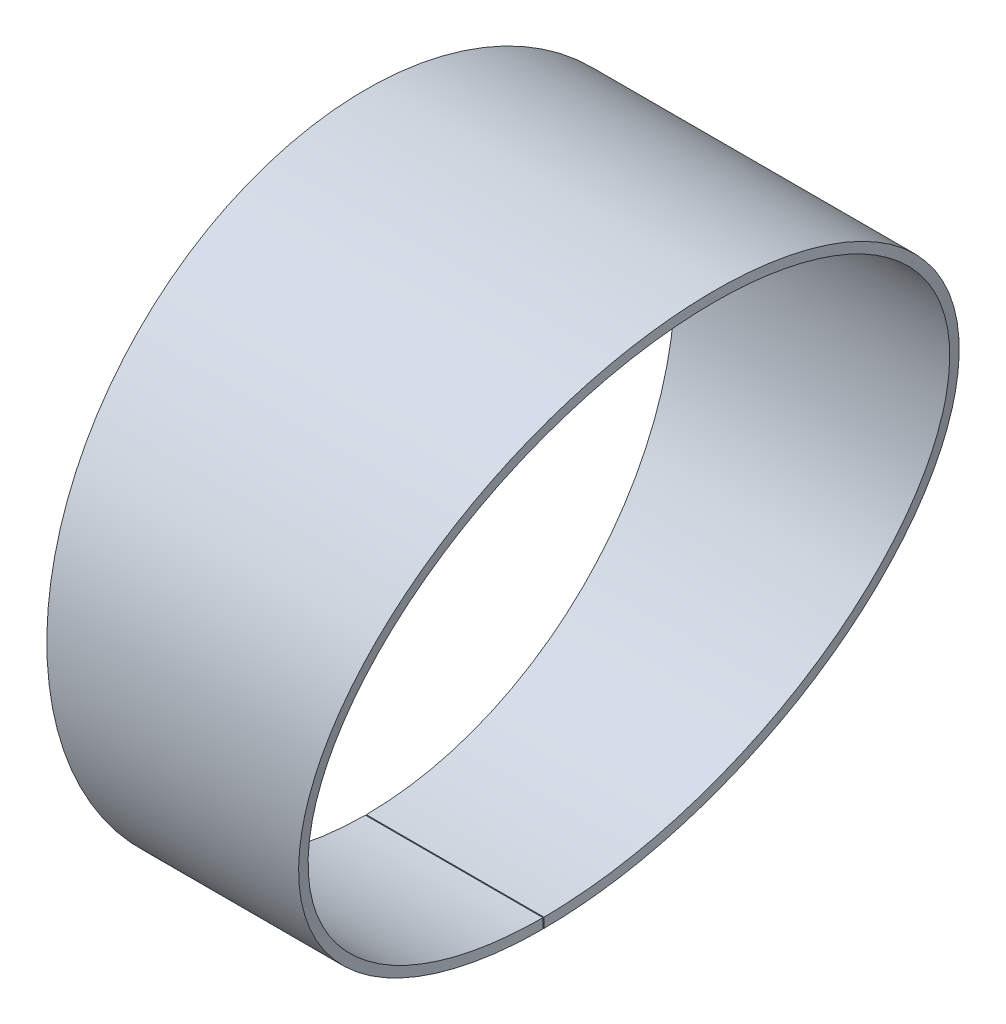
ISO-10303-21;
HEADER;
FILE_DESCRIPTION(('STEP AP214'),'2;1');
FILE_NAME('part.step','',(''),(''),'','','');
FILE_SCHEMA(('AUTOMOTIVE_DESIGN { 1 0 10303 214 1 1 1 1 }'));
ENDSEC;
DATA;
#1=APPLICATION_CONTEXT('core data for automotive mechanical design processes');
#2=APPLICATION_PROTOCOL_DEFINITION('international standard','automotive_design',2000,#1);
#3=PRODUCT_CONTEXT('',#1,'mechanical');
#4=PRODUCT('Part','Part','',(#3));
#5=PRODUCT_RELATED_PRODUCT_CATEGORY('part','',(#4));
#6=PRODUCT_DEFINITION_FORMATION('','',#4);
#7=PRODUCT_DEFINITION_CONTEXT('part definition',#1,'design');
#8=PRODUCT_DEFINITION('design','',#6,#7);
#9=PRODUCT_DEFINITION_SHAPE('','',#8);
#10=(LENGTH_UNIT() NAMED_UNIT(*) SI_UNIT(.MILLI.,.METRE.));
#11=(NAMED_UNIT(*) PLANE_ANGLE_UNIT() SI_UNIT($,.RADIAN.));
#12=(NAMED_UNIT(*) SI_UNIT($,.STERADIAN.) SOLID_ANGLE_UNIT());
#13=UNCERTAINTY_MEASURE_WITH_UNIT(LENGTH_MEASURE(1.E-05),#10,'distance_accuracy_value','');
#14=(GEOMETRIC_REPRESENTATION_CONTEXT(3) GLOBAL_UNCERTAINTY_ASSIGNED_CONTEXT((#13)) GLOBAL_UNIT_ASSIGNED_CONTEXT((#10,
#11,#12)) REPRESENTATION_CONTEXT('',''));
#15=CARTESIAN_POINT('',(0.,0.,0.));
#16=DIRECTION('',(0.,0.,1.));
#17=DIRECTION('',(1.,0.,0.));
#18=AXIS2_PLACEMENT_3D('',#15,#16,#17);
#19=CARTESIAN_POINT('',(-909.567096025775,685.000372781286,-0.484615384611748));
#20=DIRECTION('',(0.,-0.00153846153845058,0.999998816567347));
#21=DIRECTION('',(-1.,0.,0.));
#22=AXIS2_PLACEMENT_3D('',#19,#20,#21);
#23=PLANE('',#22);
#24=CARTESIAN_POINT('',(-819.134192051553,685.000372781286,-0.484615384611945));
#25=CARTESIAN_POINT('',(-819.134192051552,675.000384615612,-0.49999999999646));
#26=B_SPLINE_CURVE_WITH_KNOTS('',1,(#24,#25),.UNSPECIFIED.,.F.,.F.,(2,2),(0.,1.),.UNSPECIFIED.);
#27=CARTESIAN_POINT('',(-819.134192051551,685.000372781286,-0.484615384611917));
#28=VERTEX_POINT('',#27);
#29=CARTESIAN_POINT('',(-819.134192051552,675.000384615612,-0.499999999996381));
#30=VERTEX_POINT('',#29);
#31=EDGE_CURVE('E13',#28,#30,#26,.T.);
#32=ORIENTED_EDGE('',*,*,#31,.F.);
#33=DIRECTION('',(-1.,0.,0.));
#34=VECTOR('',#33,1.);
#35=CARTESIAN_POINT('',(-819.134192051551,685.000372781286,-0.484615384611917));
#36=LINE('',#35,#34);
#37=CARTESIAN_POINT('',(-1000.,685.000372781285,-0.484615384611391));
#38=VERTEX_POINT('',#37);
#39=EDGE_CURVE('E195',#28,#38,#36,.T.);
#40=ORIENTED_EDGE('',*,*,#39,.T.);
#41=DIRECTION('',(0.,-0.999998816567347,-0.00153846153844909));
#42=VECTOR('',#41,1.);
#43=CARTESIAN_POINT('',(-1000.,685.000372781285,-0.484615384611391));
#44=LINE('',#43,#42);
#45=CARTESIAN_POINT('',(-1000.,675.000384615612,-0.499999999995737));
#46=VERTEX_POINT('',#45);
#47=EDGE_CURVE('E50',#38,#46,#44,.T.);
#48=ORIENTED_EDGE('',*,*,#47,.T.);
#49=DIRECTION('',(1.,0.,0.));
#50=VECTOR('',#49,1.);
#51=CARTESIAN_POINT('',(-3009.89558365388,675.000384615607,-0.499999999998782));
#52=LINE('',#51,#50);
#53=EDGE_CURVE('E101',#30,#46,#52,.F.);
#54=ORIENTED_EDGE('',*,*,#53,.F.);
#55=EDGE_LOOP('',(#32,#40,#48,#54));
#56=FACE_BOUND('',#55,.T.);
#57=ADVANCED_FACE('F36',(#56),#23,.T.);
#58=CARTESIAN_POINT('',(-1000.,1000.,0.));
#59=DIRECTION('',(-1.,0.,0.));
#60=DIRECTION('',(0.,-1.,0.));
#61=AXIS2_PLACEMENT_3D('',#58,#59,#60);
#62=PLANE('',#61);
#63=ORIENTED_EDGE('',*,*,#47,.F.);
#64=CARTESIAN_POINT('',(-1000.,1000.,0.));
#65=DIRECTION('',(1.,0.,0.));
#66=DIRECTION('',(0.,1.,0.));
#67=AXIS2_PLACEMENT_3D('',#64,#65,#66);
#68=CIRCLE('',#67,315.);
#69=CARTESIAN_POINT('',(-1000.,685.000372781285,0.484615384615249));
#70=VERTEX_POINT('',#69);
#71=EDGE_CURVE('E93',#38,#70,#68,.T.);
#72=ORIENTED_EDGE('',*,*,#71,.T.);
#73=DIRECTION('',(0.,-0.999998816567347,0.00153846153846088));
#74=VECTOR('',#73,1.);
#75=CARTESIAN_POINT('',(-1000.,685.000372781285,0.484615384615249));
#76=LINE('',#75,#74);
#77=CARTESIAN_POINT('',(-1000.,675.000384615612,0.499999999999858));
#78=VERTEX_POINT('',#77);
#79=EDGE_CURVE('E88',#70,#78,#76,.T.);
#80=ORIENTED_EDGE('',*,*,#79,.T.);
#81=CARTESIAN_POINT('',(-1000.,1000.,0.));
#82=DIRECTION('',(1.,0.,0.));
#83=DIRECTION('',(0.,1.,0.));
#84=AXIS2_PLACEMENT_3D('',#81,#82,#83);
#85=CIRCLE('',#84,325.);
#86=EDGE_CURVE('E91',#46,#78,#85,.T.);
#87=ORIENTED_EDGE('',*,*,#86,.F.);
#88=EDGE_LOOP('',(#63,#72,#80,#87));
#89=FACE_BOUND('',#88,.T.);
#90=ADVANCED_FACE('F90',(#89),#62,.T.);
#91=CARTESIAN_POINT('',(-909.567096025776,685.000372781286,0.484615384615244));
#92=DIRECTION('',(0.,0.00153846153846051,0.999998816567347));
#93=DIRECTION('',(-1.,0.,0.));
#94=AXIS2_PLACEMENT_3D('',#91,#92,#93);
#95=PLANE('',#94);
#96=ORIENTED_EDGE('',*,*,#79,.F.);
#97=DIRECTION('',(-1.,0.,0.));
#98=VECTOR('',#97,1.);
#99=CARTESIAN_POINT('',(-819.134192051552,685.000372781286,0.484615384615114));
#100=LINE('',#99,#98);
#101=CARTESIAN_POINT('',(-819.134192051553,685.000372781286,0.484615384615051));
#102=VERTEX_POINT('',#101);
#103=EDGE_CURVE('E102',#102,#70,#100,.T.);
#104=ORIENTED_EDGE('',*,*,#103,.F.);
#105=CARTESIAN_POINT('',(-819.134192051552,675.000384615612,0.499999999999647));
#106=CARTESIAN_POINT('',(-819.134192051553,685.000372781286,0.484615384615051));
#107=B_SPLINE_CURVE_WITH_KNOTS('',1,(#105,#106),.UNSPECIFIED.,.F.,.F.,(2,2),(0.,1.),.UNSPECIFIED.);
#108=CARTESIAN_POINT('',(-819.134192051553,675.000384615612,0.499999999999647));
#109=VERTEX_POINT('',#108);
#110=EDGE_CURVE('E58',#102,#109,#107,.F.);
#111=ORIENTED_EDGE('',*,*,#110,.T.);
#112=DIRECTION('',(1.,0.,0.));
#113=VECTOR('',#112,1.);
#114=CARTESIAN_POINT('',(-3009.89558365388,675.000384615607,0.499999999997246));
#115=LINE('',#114,#113);
#116=EDGE_CURVE('E100',#109,#78,#115,.F.);
#117=ORIENTED_EDGE('',*,*,#116,.T.);
#118=EDGE_LOOP('',(#96,#104,#111,#117));
#119=FACE_BOUND('',#118,.T.);
#120=ADVANCED_FACE('F104',(#119),#95,.F.);
#121=CARTESIAN_POINT('',(-819.134192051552,675.000384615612,0.499999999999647));
#122=CARTESIAN_POINT('',(-819.133207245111,675.001783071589,1.40899530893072));
#123=CARTESIAN_POINT('',(-819.131962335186,675.006789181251,2.21559104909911));
#124=CARTESIAN_POINT('',(-819.129704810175,675.016279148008,3.27187433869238));
#125=CARTESIAN_POINT('',(-819.128887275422,675.019781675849,3.59836730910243));
#126=CARTESIAN_POINT('',(-819.127122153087,675.027002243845,4.20015222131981));
#127=CARTESIAN_POINT('',(-819.126181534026,675.030606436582,4.46781226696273));
#128=CARTESIAN_POINT('',(-819.121067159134,675.04959115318,5.77246750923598));
#129=CARTESIAN_POINT('',(-819.115551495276,675.069963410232,6.82688221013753));
#130=CARTESIAN_POINT('',(-819.094732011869,675.147573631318,10.0220296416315));
#131=CARTESIAN_POINT('',(-819.0751249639,675.220911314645,12.1719683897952));
#132=CARTESIAN_POINT('',(-818.99902580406,675.504779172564,18.6092640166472));
#133=CARTESIAN_POINT('',(-818.925347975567,675.779792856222,22.9079959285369));
#134=CARTESIAN_POINT('',(-818.63588588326,676.860121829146,35.7728266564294));
#135=CARTESIAN_POINT('',(-818.351469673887,677.921450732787,44.3273246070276));
#136=CARTESIAN_POINT('',(-817.599401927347,680.72837714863,61.3606913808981));
#137=CARTESIAN_POINT('',(-817.132067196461,682.472183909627,69.8317930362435));
#138=CARTESIAN_POINT('',(-816.011262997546,686.653843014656,86.6866726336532));
#139=CARTESIAN_POINT('',(-815.358113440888,689.091165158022,95.0648659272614));
#140=CARTESIAN_POINT('',(-813.86631941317,694.659472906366,111.663757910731));
#141=CARTESIAN_POINT('',(-813.027978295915,697.789295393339,119.881725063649));
#142=CARTESIAN_POINT('',(-811.164537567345,704.743048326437,136.111243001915));
#143=CARTESIAN_POINT('',(-810.136844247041,708.577212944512,144.14604015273));
#144=CARTESIAN_POINT('',(-807.889511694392,716.964031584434,159.987381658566));
#145=CARTESIAN_POINT('',(-806.669872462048,721.516704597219,167.79390786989));
#146=CARTESIAN_POINT('',(-804.038648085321,731.337873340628,183.107626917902));
#147=CARTESIAN_POINT('',(-802.627153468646,736.604653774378,190.615378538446));
#148=CARTESIAN_POINT('',(-799.593429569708,747.92499491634,205.352192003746));
#149=CARTESIAN_POINT('',(-797.973548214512,753.970631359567,212.567978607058));
#150=CARTESIAN_POINT('',(-795.389197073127,763.617015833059,223.093553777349));
#151=CARTESIAN_POINT('',(-794.501991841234,766.928720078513,226.552356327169));
#152=CARTESIAN_POINT('',(-792.676071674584,773.743572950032,233.358567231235));
#153=CARTESIAN_POINT('',(-791.736299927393,777.250366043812,236.71005182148));
#154=CARTESIAN_POINT('',(-788.824575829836,788.115095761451,246.629235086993));
#155=CARTESIAN_POINT('',(-786.764794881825,795.801380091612,253.045186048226));
#156=CARTESIAN_POINT('',(-783.497176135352,807.997805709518,262.271125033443));
#157=CARTESIAN_POINT('',(-782.378311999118,812.17431214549,265.280028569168));
#158=CARTESIAN_POINT('',(-780.08126795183,820.748026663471,271.14703138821));
#159=CARTESIAN_POINT('',(-778.904040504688,825.141294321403,274.003217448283));
#160=CARTESIAN_POINT('',(-776.474704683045,834.207498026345,279.582146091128));
#161=CARTESIAN_POINT('',(-775.224426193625,838.873661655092,282.299959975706));
#162=CARTESIAN_POINT('',(-772.652648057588,848.471899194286,287.565990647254));
#163=CARTESIAN_POINT('',(-771.331871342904,853.400959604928,290.113468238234));
#164=CARTESIAN_POINT('',(-768.598320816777,863.602487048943,295.047151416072));
#165=CARTESIAN_POINT('',(-767.188100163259,868.865674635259,297.42797565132));
#166=CARTESIAN_POINT('',(-765.007601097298,877.003588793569,300.841379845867));
#167=CARTESIAN_POINT('',(-764.270538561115,879.754308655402,301.952068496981));
#168=CARTESIAN_POINT('',(-762.76493634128,885.373085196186,304.129492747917));
#169=CARTESIAN_POINT('',(-761.997533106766,888.236961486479,305.194391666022));
#170=CARTESIAN_POINT('',(-760.433522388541,894.073897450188,307.269025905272));
#171=CARTESIAN_POINT('',(-759.636914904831,897.046958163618,308.278760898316));
#172=CARTESIAN_POINT('',(-758.014495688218,903.102124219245,310.235273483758));
#173=CARTESIAN_POINT('',(-757.191061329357,906.175357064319,311.179512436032));
#174=CARTESIAN_POINT('',(-754.659744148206,915.622059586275,313.924152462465));
#175=CARTESIAN_POINT('',(-752.879301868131,922.266347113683,315.648213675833));
#176=CARTESIAN_POINT('',(-750.537627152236,931.006010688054,317.597286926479));
#177=CARTESIAN_POINT('',(-750.063486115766,932.775628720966,317.976772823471));
#178=CARTESIAN_POINT('',(-749.103591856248,936.35813875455,318.713127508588));
#179=CARTESIAN_POINT('',(-748.620190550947,938.162259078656,319.068415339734));
#180=CARTESIAN_POINT('',(-747.129496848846,943.72530295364,320.113101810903));
#181=CARTESIAN_POINT('',(-746.083848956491,947.627204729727,320.779121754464));
#182=CARTESIAN_POINT('',(-743.888848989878,955.818935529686,322.009608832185));
#183=CARTESIAN_POINT('',(-742.739496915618,960.108788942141,322.574072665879));
#184=CARTESIAN_POINT('',(-741.237991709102,965.712866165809,323.188279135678));
#185=CARTESIAN_POINT('',(-740.934449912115,966.845762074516,323.30654225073));
#186=CARTESIAN_POINT('',(-740.474276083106,968.563189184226,323.476518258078));
#187=CARTESIAN_POINT('',(-740.321854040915,969.13205374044,323.531342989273));
#188=CARTESIAN_POINT('',(-740.001678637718,970.326841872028,323.643111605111));
#189=CARTESIAN_POINT('',(-739.834918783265,970.949073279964,323.699653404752));
#190=CARTESIAN_POINT('',(-738.967758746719,974.184558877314,323.983509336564));
#191=CARTESIAN_POINT('',(-738.167276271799,977.170883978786,324.214951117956));
#192=CARTESIAN_POINT('',(-736.352802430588,983.941968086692,324.620767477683));
#193=CARTESIAN_POINT('',(-735.338811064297,987.726818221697,324.795139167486));
#194=CARTESIAN_POINT('',(-733.657692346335,994.002228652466,324.951388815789));
#195=CARTESIAN_POINT('',(-733.070630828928,996.193684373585,324.985783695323));
#196=CARTESIAN_POINT('',(-732.150005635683,999.629807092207,325.001807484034));
#197=CARTESIAN_POINT('',(-731.833073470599,1000.81257436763,325.00100582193));
#198=CARTESIAN_POINT('',(-731.218822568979,1003.1051839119,324.987187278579));
#199=CARTESIAN_POINT('',(-730.91826921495,1004.22704152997,324.974363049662));
#200=CARTESIAN_POINT('',(-728.272437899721,1014.10327075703,324.812541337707));
#201=CARTESIAN_POINT('',(-726.341202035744,1021.31101427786,324.349851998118));
#202=CARTESIAN_POINT('',(-724.452924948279,1028.3561727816,323.763689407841));
#203=CARTESIAN_POINT('',(-724.101557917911,1029.66713312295,323.645402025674));
#204=CARTESIAN_POINT('',(-723.613939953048,1031.48679638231,323.471718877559));
#205=CARTESIAN_POINT('',(-723.458185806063,1032.06810077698,323.414568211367));
#206=CARTESIAN_POINT('',(-723.144554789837,1033.23861496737,323.296366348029));
#207=CARTESIAN_POINT('',(-722.988581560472,1033.82073857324,323.23597675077));
#208=CARTESIAN_POINT('',(-722.21292680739,1036.7156716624,322.927830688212));
#209=CARTESIAN_POINT('',(-721.605879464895,1038.98141743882,322.661490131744));
#210=CARTESIAN_POINT('',(-719.825166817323,1045.6275995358,321.812172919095));
#211=CARTESIAN_POINT('',(-718.691930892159,1049.85689015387,321.17903472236));
#212=CARTESIAN_POINT('',(-717.072935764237,1055.89860792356,320.16326474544));
#213=CARTESIAN_POINT('',(-716.546747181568,1057.86216804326,319.813630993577));
#214=CARTESIAN_POINT('',(-715.52132293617,1061.68885464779,319.097593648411));
#215=CARTESIAN_POINT('',(-715.023801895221,1063.54564093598,318.732624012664));
#216=CARTESIAN_POINT('',(-713.543584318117,1069.07007348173,317.597955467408));
#217=CARTESIAN_POINT('',(-712.581107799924,1072.66233717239,316.793554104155));
#218=CARTESIAN_POINT('',(-710.70482516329,1079.66484896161,315.105510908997));
#219=CARTESIAN_POINT('',(-709.791019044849,1083.07510110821,314.221870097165));
#220=CARTESIAN_POINT('',(-708.012077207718,1089.71385415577,312.39122978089));
#221=CARTESIAN_POINT('',(-707.149934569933,1092.93128633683,311.447776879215));
#222=CARTESIAN_POINT('',(-704.609888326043,1102.41109728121,308.51375004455));
#223=CARTESIAN_POINT('',(-702.977936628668,1108.50187304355,306.417283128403));
#224=CARTESIAN_POINT('',(-699.836858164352,1120.22415686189,302.010529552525));
#225=CARTESIAN_POINT('',(-698.331279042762,1125.84303058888,299.706875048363));
#226=CARTESIAN_POINT('',(-695.403210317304,1136.77102095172,294.880258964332));
#227=CARTESIAN_POINT('',(-693.984948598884,1142.06394779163,292.362513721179));
#228=CARTESIAN_POINT('',(-691.239970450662,1152.30805235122,287.158948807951));
#229=CARTESIAN_POINT('',(-689.911964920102,1157.26442774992,284.471261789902));
#230=CARTESIAN_POINT('',(-687.32586781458,1166.9160184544,278.917625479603));
#231=CARTESIAN_POINT('',(-686.070387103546,1171.60138680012,276.056544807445));
#232=CARTESIAN_POINT('',(-683.634561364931,1180.69183526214,270.193842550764));
#233=CARTESIAN_POINT('',(-682.451614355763,1185.10718082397,267.186057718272));
#234=CARTESIAN_POINT('',(-678.992110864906,1198.02031428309,257.924768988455));
#235=CARTESIAN_POINT('',(-676.811117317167,1206.16049749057,251.449001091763));
#236=CARTESIAN_POINT('',(-673.727640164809,1217.66642774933,241.396487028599));
#237=CARTESIAN_POINT('',(-672.731149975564,1221.38450958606,237.989091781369));
#238=CARTESIAN_POINT('',(-670.800840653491,1228.58778123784,231.079066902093));
#239=CARTESIAN_POINT('',(-669.866355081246,1232.07572262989,227.574310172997));
#240=CARTESIAN_POINT('',(-667.140706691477,1242.24947513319,216.880203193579));
#241=CARTESIAN_POINT('',(-665.432553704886,1248.62531667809,209.529558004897));
#242=CARTESIAN_POINT('',(-662.23413961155,1260.56088444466,194.487041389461));
#243=CARTESIAN_POINT('',(-660.745704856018,1266.11412132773,186.805310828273));
#244=CARTESIAN_POINT('',(-657.978238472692,1276.44320771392,171.149357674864));
#245=CARTESIAN_POINT('',(-656.696039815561,1281.22968351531,163.156930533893));
#246=CARTESIAN_POINT('',(-654.334711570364,1290.04239971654,146.920812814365));
#247=CARTESIAN_POINT('',(-653.255581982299,1294.0686617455,138.677143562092));
#248=CARTESIAN_POINT('',(-651.300391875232,1301.36437725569,122.013278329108));
#249=CARTESIAN_POINT('',(-650.42286069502,1304.64033471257,113.580129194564));
#250=CARTESIAN_POINT('',(-648.862388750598,1310.46513805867,96.5275988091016));
#251=CARTESIAN_POINT('',(-648.18028191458,1313.01065875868,87.9156688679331));
#252=CARTESIAN_POINT('',(-647.012326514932,1317.36828603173,70.5847600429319));
#253=CARTESIAN_POINT('',(-646.52686286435,1319.17952497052,61.873541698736));
#254=CARTESIAN_POINT('',(-645.360379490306,1323.53430016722,35.5833374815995));
#255=CARTESIAN_POINT('',(-644.970146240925,1324.98949598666,17.8646902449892));
#256=CARTESIAN_POINT('',(-644.964524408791,1325.01039043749,-17.4804395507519));
#257=CARTESIAN_POINT('',(-645.349160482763,1323.57625417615,-35.1998292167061));
#258=CARTESIAN_POINT('',(-646.507285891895,1319.2526167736,-61.4952985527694));
#259=CARTESIAN_POINT('',(-646.98994066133,1317.45176871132,-70.2082884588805));
#260=CARTESIAN_POINT('',(-648.152326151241,1313.11494433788,-87.5434798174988));
#261=CARTESIAN_POINT('',(-648.831677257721,1310.5797620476,-96.1581398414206));
#262=CARTESIAN_POINT('',(-650.386696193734,1304.77536123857,-113.217293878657));
#263=CARTESIAN_POINT('',(-651.261583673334,1301.50922814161,-121.654830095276));
#264=CARTESIAN_POINT('',(-653.21123981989,1294.23406409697,-138.325803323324));
#265=CARTESIAN_POINT('',(-654.287624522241,1290.21805082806,-146.573479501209));
#266=CARTESIAN_POINT('',(-656.643507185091,1281.42569699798,-162.818546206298));
#267=CARTESIAN_POINT('',(-657.92300514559,1276.64933480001,-170.81591544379));
#268=CARTESIAN_POINT('',(-660.685114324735,1266.34025231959,-186.482710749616));
#269=CARTESIAN_POINT('',(-662.170573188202,1260.79812296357,-194.16867534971));
#270=CARTESIAN_POINT('',(-665.363207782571,1248.88417455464,-209.221899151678));
#271=CARTESIAN_POINT('',(-667.06846359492,1242.51917245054,-216.578457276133));
#272=CARTESIAN_POINT('',(-669.789755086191,1232.36163948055,-227.282341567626));
#273=CARTESIAN_POINT('',(-670.722842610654,1228.87887453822,-230.790693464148));
#274=CARTESIAN_POINT('',(-672.649796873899,1221.68805629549,-237.706308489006));
#275=CARTESIAN_POINT('',(-673.644617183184,1217.97620515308,-241.116748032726));
#276=CARTESIAN_POINT('',(-676.723107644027,1206.48892690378,-251.179162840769));
#277=CARTESIAN_POINT('',(-678.900807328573,1198.36112604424,-257.662556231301));
#278=CARTESIAN_POINT('',(-682.355415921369,1185.46625893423,-266.936882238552));
#279=CARTESIAN_POINT('',(-683.536918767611,1181.05624420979,-269.949710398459));
#280=CARTESIAN_POINT('',(-685.968842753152,1171.98033510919,-275.820546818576));
#281=CARTESIAN_POINT('',(-687.22240080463,1167.30215913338,-278.686105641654));
#282=CARTESIAN_POINT('',(-689.804709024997,1157.66472724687,-284.249523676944));
#283=CARTESIAN_POINT('',(-691.130957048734,1152.71488846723,-286.942688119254));
#284=CARTESIAN_POINT('',(-693.871382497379,1142.48776119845,-292.156090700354));
#285=CARTESIAN_POINT('',(-695.287409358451,1137.20320165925,-294.679318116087));
#286=CARTESIAN_POINT('',(-698.211091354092,1126.29159647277,-299.5180323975));
#287=CARTESIAN_POINT('',(-699.71418135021,1120.68196561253,-301.827716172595));
#288=CARTESIAN_POINT('',(-702.849404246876,1108.98155417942,-306.246841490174));
#289=CARTESIAN_POINT('',(-704.47849238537,1102.90150672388,-308.35036262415));
#290=CARTESIAN_POINT('',(-707.014339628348,1093.43733766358,-311.29629050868));
#291=CARTESIAN_POINT('',(-707.87420764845,1090.22835951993,-312.242932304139));
#292=CARTESIAN_POINT('',(-709.648542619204,1083.60680212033,-314.080735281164));
#293=CARTESIAN_POINT('',(-710.560071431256,1080.20506930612,-314.968358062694));
#294=CARTESIAN_POINT('',(-712.431851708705,1073.21939347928,-316.665186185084));
#295=CARTESIAN_POINT('',(-713.392103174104,1069.63544641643,-317.474390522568));
#296=CARTESIAN_POINT('',(-714.869022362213,1064.12329884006,-318.616891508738));
#297=CARTESIAN_POINT('',(-715.364998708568,1062.2722476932,-318.984200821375));
#298=CARTESIAN_POINT('',(-716.385193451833,1058.46503886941,-319.703913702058));
#299=CARTESIAN_POINT('',(-716.908781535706,1056.51118239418,-320.055650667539));
#300=CARTESIAN_POINT('',(-718.520017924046,1050.49844589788,-321.078557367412));
#301=CARTESIAN_POINT('',(-719.648138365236,1046.28830439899,-321.717556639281));
#302=CARTESIAN_POINT('',(-721.421263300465,1039.67047243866,-322.577435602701));
#303=CARTESIAN_POINT('',(-722.025795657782,1037.41411416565,-322.847591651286));
#304=CARTESIAN_POINT('',(-722.952830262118,1033.95416479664,-323.223545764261));
#305=CARTESIAN_POINT('',(-723.265214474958,1032.78828140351,-323.343981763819));
#306=CARTESIAN_POINT('',(-723.896728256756,1030.43143748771,-323.574302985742));
#307=CARTESIAN_POINT('',(-724.236290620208,1029.16445154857,-323.691711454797));
#308=CARTESIAN_POINT('',(-726.071545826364,1022.31704329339,-324.279475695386));
#309=CARTESIAN_POINT('',(-727.960203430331,1015.26893807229,-324.755579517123));
#310=CARTESIAN_POINT('',(-730.557953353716,1005.57200033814,-324.954018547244));
#311=CARTESIAN_POINT('',(-730.853161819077,1004.47005677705,-324.971210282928));
#312=CARTESIAN_POINT('',(-731.45671791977,1002.21724872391,-324.994388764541));
#313=CARTESIAN_POINT('',(-731.767305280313,1001.05806400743,-325.000367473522));
#314=CARTESIAN_POINT('',(-732.704160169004,997.561606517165,-324.999211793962));
#315=CARTESIAN_POINT('',(-733.302053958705,995.329777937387,-324.973441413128));
#316=CARTESIAN_POINT('',(-735.015706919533,988.932946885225,-324.839521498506));
#317=CARTESIAN_POINT('',(-736.051437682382,985.066756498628,-324.675310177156));
#318=CARTESIAN_POINT('',(-737.909490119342,978.132739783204,-324.282102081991));
#319=CARTESIAN_POINT('',(-738.731811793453,975.064820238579,-324.053108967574));
#320=CARTESIAN_POINT('',(-739.626333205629,971.727339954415,-323.768598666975));
#321=CARTESIAN_POINT('',(-739.798568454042,971.084708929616,-323.711740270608));
#322=CARTESIAN_POINT('',(-740.12970088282,969.849121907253,-323.598994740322));
#323=CARTESIAN_POINT('',(-740.28715687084,969.26152790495,-323.543629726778));
#324=CARTESIAN_POINT('',(-740.749561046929,967.535803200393,-323.376579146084));
#325=CARTESIAN_POINT('',(-741.054586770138,966.397380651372,-323.260185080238));
#326=CARTESIAN_POINT('',(-742.563496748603,960.765702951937,-322.654927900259));
#327=CARTESIAN_POINT('',(-743.718725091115,956.453875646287,-322.096356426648));
#328=CARTESIAN_POINT('',(-745.925382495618,948.218567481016,-320.875382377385));
#329=CARTESIAN_POINT('',(-746.976811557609,944.295062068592,-320.212983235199));
#330=CARTESIAN_POINT('',(-748.476105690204,938.69997659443,-319.17221968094));
#331=CARTESIAN_POINT('',(-748.961330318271,936.889077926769,-318.818715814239));
#332=CARTESIAN_POINT('',(-749.924117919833,933.295784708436,-318.086324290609));
#333=CARTESIAN_POINT('',(-750.399700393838,931.520788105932,-317.708706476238));
#334=CARTESIAN_POINT('',(-752.748556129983,922.754311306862,-315.768424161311));
#335=CARTESIAN_POINT('',(-754.534659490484,916.088832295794,-314.049637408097));
#336=CARTESIAN_POINT('',(-757.074342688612,906.610956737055,-311.310618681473));
#337=CARTESIAN_POINT('',(-757.899456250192,903.531474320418,-310.369113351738));
#338=CARTESIAN_POINT('',(-759.525770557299,897.461769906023,-308.41704612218));
#339=CARTESIAN_POINT('',(-760.324311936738,894.481482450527,-307.409294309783));
#340=CARTESIAN_POINT('',(-761.892163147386,888.630196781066,-305.338171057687));
#341=CARTESIAN_POINT('',(-762.661472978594,885.759197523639,-304.274799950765));
#342=CARTESIAN_POINT('',(-764.170861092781,880.126295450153,-302.099999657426));
#343=CARTESIAN_POINT('',(-764.909725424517,877.368869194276,-300.990509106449));
#344=CARTESIAN_POINT('',(-767.094828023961,869.213789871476,-297.581401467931));
#345=CARTESIAN_POINT('',(-768.508071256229,863.939301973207,-295.202803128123));
#346=CARTESIAN_POINT('',(-771.247574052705,853.71554434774,-290.272400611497));
#347=CARTESIAN_POINT('',(-772.571240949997,848.775721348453,-287.726028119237));
#348=CARTESIAN_POINT('',(-775.148139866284,839.15837609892,-282.462425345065));
#349=CARTESIAN_POINT('',(-776.400935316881,834.482804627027,-279.745366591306));
#350=CARTESIAN_POINT('',(-778.835218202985,825.398129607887,-274.16710041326));
#351=CARTESIAN_POINT('',(-780.014821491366,820.996023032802,-271.310941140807));
#352=CARTESIAN_POINT('',(-782.316173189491,812.406264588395,-265.444233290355));
#353=CARTESIAN_POINT('',(-783.43713997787,808.221905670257,-262.435160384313));
#354=CARTESIAN_POINT('',(-786.710913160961,796.002474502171,-253.207845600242));
#355=CARTESIAN_POINT('',(-788.774592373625,788.301591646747,-246.789821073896));
#356=CARTESIAN_POINT('',(-792.664278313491,773.787729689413,-233.558216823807));
#357=CARTESIAN_POINT('',(-794.488445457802,766.979184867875,-226.75337944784));
#358=CARTESIAN_POINT('',(-797.940359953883,754.094525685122,-212.711760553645));
#359=CARTESIAN_POINT('',(-799.563100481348,748.038198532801,-205.491527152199));
#360=CARTESIAN_POINT('',(-802.602148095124,736.697967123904,-190.744742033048));
#361=CARTESIAN_POINT('',(-804.016102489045,731.422010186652,-183.231464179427));
#362=CARTESIAN_POINT('',(-806.651722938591,721.58443794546,-167.906762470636));
#363=CARTESIAN_POINT('',(-807.873374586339,717.024256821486,-160.094362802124));
#364=CARTESIAN_POINT('',(-810.124360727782,708.623807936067,-144.240739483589));
#365=CARTESIAN_POINT('',(-811.153695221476,704.783521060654,-136.199534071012));
#366=CARTESIAN_POINT('',(-813.020047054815,697.818879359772,-119.956879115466));
#367=CARTESIAN_POINT('',(-813.859638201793,694.68437885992,-111.732449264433));
#368=CARTESIAN_POINT('',(-815.353651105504,689.107781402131,-95.1199093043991));
#369=CARTESIAN_POINT('',(-816.007749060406,686.666923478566,-86.7347035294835));
#370=CARTESIAN_POINT('',(-817.130127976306,682.479408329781,-69.8655816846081));
#371=CARTESIAN_POINT('',(-817.598084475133,680.733299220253,-61.387401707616));
#372=CARTESIAN_POINT('',(-818.351100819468,677.922805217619,-44.338695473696));
#373=CARTESIAN_POINT('',(-818.635850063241,676.860272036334,-35.7764111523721));
#374=CARTESIAN_POINT('',(-818.925560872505,675.779006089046,-22.8977281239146));
#375=CARTESIAN_POINT('',(-818.999282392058,675.503834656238,-18.5941144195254));
#376=CARTESIAN_POINT('',(-819.0626859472,675.267307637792,-13.2225153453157));
#377=CARTESIAN_POINT('',(-819.073925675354,675.225376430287,-12.1489165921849));
#378=CARTESIAN_POINT('',(-819.093523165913,675.152209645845,-10.0032690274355));
#379=CARTESIAN_POINT('',(-819.101884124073,675.120856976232,-8.92598881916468));
#380=CARTESIAN_POINT('',(-819.115707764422,675.069401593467,-6.79978436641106));
#381=CARTESIAN_POINT('',(-819.121168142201,675.049327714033,-5.75463449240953));
#382=CARTESIAN_POINT('',(-819.126179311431,675.030649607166,-4.47071108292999));
#383=CARTESIAN_POINT('',(-819.127099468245,675.027097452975,-4.20733080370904));
#384=CARTESIAN_POINT('',(-819.128839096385,675.01992016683,-3.61064176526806));
#385=CARTESIAN_POINT('',(-819.129649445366,675.016416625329,-3.28548729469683));
#386=CARTESIAN_POINT('',(-819.131902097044,675.006885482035,-2.22959079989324));
#387=CARTESIAN_POINT('',(-819.13316600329,675.001797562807,-1.41841458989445));
#388=CARTESIAN_POINT('',(-819.134192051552,675.000384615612,-0.49999999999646));
#389=CARTESIAN_POINT('',(-819.134192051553,685.000372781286,0.484615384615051));
#390=CARTESIAN_POINT('',(-819.133207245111,685.001728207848,1.3656416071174));
#391=CARTESIAN_POINT('',(-819.131962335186,685.006580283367,2.14741901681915));
#392=CARTESIAN_POINT('',(-819.129704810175,685.015778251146,3.17120128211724));
#393=CARTESIAN_POINT('',(-819.128887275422,685.0191730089,3.48764831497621));
#394=CARTESIAN_POINT('',(-819.127122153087,685.026171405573,4.07091676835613));
#395=CARTESIAN_POINT('',(-819.126181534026,685.029664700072,4.33034112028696));
#396=CARTESIAN_POINT('',(-819.121067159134,685.048065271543,5.59485312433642));
#397=CARTESIAN_POINT('',(-819.115551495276,685.067810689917,6.61682429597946));
#398=CARTESIAN_POINT('',(-819.094732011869,685.1430329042,9.7136594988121));
#399=CARTESIAN_POINT('',(-819.0751249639,685.214114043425,11.7974462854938));
#400=CARTESIAN_POINT('',(-818.99902580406,685.489247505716,18.0366712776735));
#401=CARTESIAN_POINT('',(-818.925347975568,685.755799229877,22.2031345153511));
#402=CARTESIAN_POINT('',(-818.63588588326,686.802887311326,34.6721242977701));
#403=CARTESIAN_POINT('',(-818.351469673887,687.831559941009,42.9634069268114));
#404=CARTESIAN_POINT('',(-817.599401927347,690.552119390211,59.4726701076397));
#405=CARTESIAN_POINT('',(-817.132067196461,692.242270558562,67.6831224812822));
#406=CARTESIAN_POINT('',(-816.011262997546,696.295263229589,84.0193903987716));
#407=CARTESIAN_POINT('',(-815.358113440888,698.657590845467,92.1397931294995));
#408=CARTESIAN_POINT('',(-813.86631941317,704.054566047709,108.227949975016));
#409=CARTESIAN_POINT('',(-813.027978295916,707.088086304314,116.193056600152));
#410=CARTESIAN_POINT('',(-811.164537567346,713.827877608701,131.923204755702));
#411=CARTESIAN_POINT('',(-810.136844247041,717.544067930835,139.7107773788));
#412=CARTESIAN_POINT('',(-807.889511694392,725.672830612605,155.064692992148));
#413=CARTESIAN_POINT('',(-806.669872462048,730.085421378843,162.63101839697));
#414=CARTESIAN_POINT('',(-804.038648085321,739.604400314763,177.473546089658));
#415=CARTESIAN_POINT('',(-802.627153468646,744.709125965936,184.750289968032));
#416=CARTESIAN_POINT('',(-799.593429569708,755.681148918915,199.033663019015));
#417=CARTESIAN_POINT('',(-797.973548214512,761.540765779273,206.027425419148));
#418=CARTESIAN_POINT('',(-795.389197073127,770.890338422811,216.229136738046));
#419=CARTESIAN_POINT('',(-794.501991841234,774.100144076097,219.581514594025));
#420=CARTESIAN_POINT('',(-792.676071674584,780.705309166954,226.17830362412));
#421=CARTESIAN_POINT('',(-791.736299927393,784.104200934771,229.426665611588));
#422=CARTESIAN_POINT('',(-788.824575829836,794.634631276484,239.040643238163));
#423=CARTESIAN_POINT('',(-786.764794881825,802.084414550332,245.259180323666));
#424=CARTESIAN_POINT('',(-783.497176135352,813.905565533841,254.201244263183));
#425=CARTESIAN_POINT('',(-782.378311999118,817.953564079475,257.117566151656));
#426=CARTESIAN_POINT('',(-780.08126795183,826.263471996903,262.804045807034));
#427=CARTESIAN_POINT('',(-778.904040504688,830.521562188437,265.572349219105));
#428=CARTESIAN_POINT('',(-776.474704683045,839.30880577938,270.979618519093));
#429=CARTESIAN_POINT('',(-775.224426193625,843.831395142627,273.613807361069));
#430=CARTESIAN_POINT('',(-772.652648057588,853.134302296,278.717806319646));
#431=CARTESIAN_POINT('',(-771.331871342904,857.911699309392,281.18689998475));
#432=CARTESIAN_POINT('',(-768.598320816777,867.799333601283,285.968777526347));
#433=CARTESIAN_POINT('',(-767.188100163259,872.900576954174,288.27634563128));
#434=CARTESIAN_POINT('',(-765.007601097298,880.788093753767,291.584722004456));
#435=CARTESIAN_POINT('',(-764.270538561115,883.454176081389,292.661235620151));
#436=CARTESIAN_POINT('',(-762.76493634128,888.90006719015,294.771662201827));
#437=CARTESIAN_POINT('',(-761.997533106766,891.675824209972,295.803794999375));
#438=CARTESIAN_POINT('',(-760.433522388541,897.333162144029,297.814594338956));
#439=CARTESIAN_POINT('',(-759.636914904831,900.214744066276,298.793260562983));
#440=CARTESIAN_POINT('',(-758.014495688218,906.083597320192,300.689572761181));
#441=CARTESIAN_POINT('',(-757.191061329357,909.062269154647,301.604758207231));
#442=CARTESIAN_POINT('',(-754.659744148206,918.218303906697,304.264947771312));
#443=CARTESIAN_POINT('',(-752.879301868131,924.658151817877,305.935960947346));
#444=CARTESIAN_POINT('',(-750.537627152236,933.128902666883,307.825062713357));
#445=CARTESIAN_POINT('',(-750.063486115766,934.844070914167,308.192872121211));
#446=CARTESIAN_POINT('',(-749.103591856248,938.316349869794,308.906569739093));
#447=CARTESIAN_POINT('',(-748.620190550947,940.064958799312,309.250925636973));
#448=CARTESIAN_POINT('',(-747.129496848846,945.456832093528,310.263467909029));
#449=CARTESIAN_POINT('',(-746.083848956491,949.238675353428,310.908994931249));
#450=CARTESIAN_POINT('',(-743.888848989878,957.178352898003,312.101620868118));
#451=CARTESIAN_POINT('',(-742.739496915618,961.336210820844,312.648716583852));
#452=CARTESIAN_POINT('',(-741.237991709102,966.767854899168,313.244024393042));
#453=CARTESIAN_POINT('',(-740.934449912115,967.865892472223,313.358648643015));
#454=CARTESIAN_POINT('',(-740.474276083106,969.530475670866,313.523394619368));
#455=CARTESIAN_POINT('',(-740.321854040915,970.081836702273,313.576532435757));
#456=CARTESIAN_POINT('',(-740.001678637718,971.239862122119,313.684862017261));
#457=CARTESIAN_POINT('',(-739.834918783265,971.842947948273,313.739664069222));
#458=CARTESIAN_POINT('',(-738.967758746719,974.978880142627,314.014785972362));
#459=CARTESIAN_POINT('',(-738.167276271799,977.8733183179,314.239106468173));
#460=CARTESIAN_POINT('',(-736.352802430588,984.436061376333,314.632436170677));
#461=CARTESIAN_POINT('',(-735.338811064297,988.104454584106,314.801442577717));
#462=CARTESIAN_POINT('',(-733.657692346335,994.18677546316,314.952884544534));
#463=CARTESIAN_POINT('',(-733.070630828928,996.310801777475,314.986221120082));
#464=CARTESIAN_POINT('',(-732.150005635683,999.641197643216,315.00175186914));
#465=CARTESIAN_POINT('',(-731.833073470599,1000.78757207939,315.000974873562));
#466=CARTESIAN_POINT('',(-731.218822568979,1003.00963979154,314.987581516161));
#467=CARTESIAN_POINT('',(-730.91826921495,1004.09697871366,314.975151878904));
#468=CARTESIAN_POINT('',(-728.272437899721,1013.66932396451,314.818309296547));
#469=CARTESIAN_POINT('',(-726.341202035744,1020.65529076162,314.369856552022));
#470=CARTESIAN_POINT('',(-724.452924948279,1027.48367515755,313.801729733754));
#471=CARTESIAN_POINT('',(-724.101557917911,1028.75429825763,313.687081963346));
#472=CARTESIAN_POINT('',(-723.613939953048,1030.51797187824,313.518742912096));
#473=CARTESIAN_POINT('',(-723.458185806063,1031.08138998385,313.46335072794));
#474=CARTESIAN_POINT('',(-723.144554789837,1032.21588835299,313.348785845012));
#475=CARTESIAN_POINT('',(-722.988581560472,1032.78010046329,313.290254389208));
#476=CARTESIAN_POINT('',(-722.21292680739,1035.58595868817,312.991589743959));
#477=CARTESIAN_POINT('',(-721.605879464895,1037.78198920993,312.733444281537));
#478=CARTESIAN_POINT('',(-719.825166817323,1044.22367339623,311.9102599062));
#479=CARTESIAN_POINT('',(-718.691930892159,1048.32283199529,311.296602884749));
#480=CARTESIAN_POINT('',(-717.072935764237,1054.17865075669,310.312087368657));
#481=CARTESIAN_POINT('',(-716.546747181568,1056.08179364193,309.97321157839));
#482=CARTESIAN_POINT('',(-715.52132293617,1059.79073604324,309.279206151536));
#483=CARTESIAN_POINT('',(-715.023801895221,1061.59039044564,308.925466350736));
#484=CARTESIAN_POINT('',(-713.543584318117,1066.94484045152,307.825710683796));
#485=CARTESIAN_POINT('',(-712.581107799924,1070.4265729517,307.04606013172));
#486=CARTESIAN_POINT('',(-710.70482516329,1077.21362283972,305.409956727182));
#487=CARTESIAN_POINT('',(-709.791019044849,1080.51894415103,304.553504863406));
#488=CARTESIAN_POINT('',(-708.012077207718,1086.95342787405,302.779191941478));
#489=CARTESIAN_POINT('',(-707.149934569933,1090.07186214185,301.864768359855));
#490=CARTESIAN_POINT('',(-704.609888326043,1099.25998659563,299.021019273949));
#491=CARTESIAN_POINT('',(-702.977936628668,1105.16335387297,296.989059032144));
#492=CARTESIAN_POINT('',(-699.836858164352,1116.52495203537,292.717897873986));
#493=CARTESIAN_POINT('',(-698.331279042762,1121.97093733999,290.485125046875));
#494=CARTESIAN_POINT('',(-695.403210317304,1132.56268184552,285.807020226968));
#495=CARTESIAN_POINT('',(-693.984948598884,1137.69274939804,283.36674406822));
#496=CARTESIAN_POINT('',(-691.239970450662,1147.62165074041,278.323288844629));
#497=CARTESIAN_POINT('',(-689.911964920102,1152.42552228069,275.718299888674));
#498=CARTESIAN_POINT('',(-687.32586781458,1161.78014096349,270.335544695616));
#499=CARTESIAN_POINT('',(-686.070387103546,1166.32134412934,267.562497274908));
#500=CARTESIAN_POINT('',(-683.634561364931,1175.13208648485,261.880185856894));
#501=CARTESIAN_POINT('',(-682.451614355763,1179.41157526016,258.964948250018));
#502=CARTESIAN_POINT('',(-678.992110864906,1191.92738153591,249.988622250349));
#503=CARTESIAN_POINT('',(-676.811117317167,1199.81709756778,243.712108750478));
#504=CARTESIAN_POINT('',(-673.727640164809,1210.96899920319,233.968902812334));
#505=CARTESIAN_POINT('',(-672.731149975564,1214.57267852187,230.666350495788));
#506=CARTESIAN_POINT('',(-670.800840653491,1221.55431104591,223.968941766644));
#507=CARTESIAN_POINT('',(-669.866355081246,1224.93493116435,220.572023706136));
#508=CARTESIAN_POINT('',(-667.140706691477,1234.79564512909,210.206966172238));
#509=CARTESIAN_POINT('',(-665.432553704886,1240.97530693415,203.082494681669));
#510=CARTESIAN_POINT('',(-662.23413961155,1252.54362646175,188.502824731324));
#511=CARTESIAN_POINT('',(-660.745704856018,1257.92599451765,181.05745511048));
#512=CARTESIAN_POINT('',(-657.978238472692,1267.93726286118,165.883223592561));
#513=CARTESIAN_POINT('',(-656.696039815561,1272.57646248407,158.136717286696));
#514=CARTESIAN_POINT('',(-654.334711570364,1281.1180181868,142.400172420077));
#515=CARTESIAN_POINT('',(-653.255581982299,1285.02039523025,134.410154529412));
#516=CARTESIAN_POINT('',(-651.300391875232,1292.09162718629,118.259023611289));
#517=CARTESIAN_POINT('',(-650.42286069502,1295.26678595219,110.085355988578));
#518=CARTESIAN_POINT('',(-648.862388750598,1300.91236457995,93.5575188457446));
#519=CARTESIAN_POINT('',(-648.18028191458,1303.3795615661,85.2105713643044));
#520=CARTESIAN_POINT('',(-647.012326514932,1307.60310799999,68.4129212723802));
#521=CARTESIAN_POINT('',(-646.52686286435,1309.35861650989,59.969740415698));
#522=CARTESIAN_POINT('',(-645.360379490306,1313.57939862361,34.4884655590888));
#523=CARTESIAN_POINT('',(-644.970146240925,1314.98981918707,17.3150074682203));
#524=CARTESIAN_POINT('',(-644.964524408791,1315.01007073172,-16.9425798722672));
#525=CARTESIAN_POINT('',(-645.349160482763,1313.62006173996,-34.1167575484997));
#526=CARTESIAN_POINT('',(-646.507285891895,1309.42945933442,-59.6031355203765));
#527=CARTESIAN_POINT('',(-646.98994066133,1307.68402198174,-68.0480334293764));
#528=CARTESIAN_POINT('',(-648.152326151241,1303.48063835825,-84.8498342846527));
#529=CARTESIAN_POINT('',(-648.831677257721,1301.0234616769,-93.1994278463));
#530=CARTESIAN_POINT('',(-650.386696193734,1295.39765781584,-109.733684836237));
#531=CARTESIAN_POINT('',(-651.261583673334,1292.23202112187,-117.911604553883));
#532=CARTESIAN_POINT('',(-653.21123981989,1285.1807082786,-134.06962475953));
#533=CARTESIAN_POINT('',(-654.287624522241,1281.28826464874,-142.063526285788));
#534=CARTESIAN_POINT('',(-656.643507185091,1272.76644478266,-157.808744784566));
#535=CARTESIAN_POINT('',(-657.92300514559,1268.13704757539,-165.560041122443));
#536=CARTESIAN_POINT('',(-660.685114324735,1258.14516763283,-180.744781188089));
#537=CARTESIAN_POINT('',(-662.170573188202,1252.77356533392,-188.194254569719));
#538=CARTESIAN_POINT('',(-665.363207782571,1241.22619995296,-202.784302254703));
#539=CARTESIAN_POINT('',(-667.06846359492,1235.05704406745,-209.91450474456));
#540=CARTESIAN_POINT('',(-669.789755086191,1225.21205057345,-220.28903875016));
#541=CARTESIAN_POINT('',(-670.722842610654,1221.83644762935,-223.689441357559));
#542=CARTESIAN_POINT('',(-672.649796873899,1214.86688533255,-230.392268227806));
#543=CARTESIAN_POINT('',(-673.644617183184,1211.26924499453,-233.69777117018));
#544=CARTESIAN_POINT('',(-676.723107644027,1200.13542146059,-243.450573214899));
#545=CARTESIAN_POINT('',(-678.900807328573,1192.25770678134,-249.73447757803));
#546=CARTESIAN_POINT('',(-682.355415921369,1179.75960481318,-258.723439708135));
#547=CARTESIAN_POINT('',(-683.536918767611,1175.48528284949,-261.643565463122));
#548=CARTESIAN_POINT('',(-685.968842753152,1166.68863249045,-267.333760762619));
#549=CARTESIAN_POINT('',(-687.22240080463,1162.15440039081,-270.111148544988));
#550=CARTESIAN_POINT('',(-689.804709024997,1152.81350487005,-275.503384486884));
#551=CARTESIAN_POINT('',(-691.130957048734,1148.01596882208,-278.113682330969));
#552=CARTESIAN_POINT('',(-693.871382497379,1138.10352239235,-283.166672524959));
#553=CARTESIAN_POINT('',(-695.287409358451,1132.98156468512,-285.612262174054));
#554=CARTESIAN_POINT('',(-698.211091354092,1122.40570119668,-290.302092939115));
#555=CARTESIAN_POINT('',(-699.71418135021,1116.96867436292,-292.54070952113));
#556=CARTESIAN_POINT('',(-702.849404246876,1105.62827558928,-296.823861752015));
#557=CARTESIAN_POINT('',(-704.47849238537,1099.73530651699,-298.862659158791));
#558=CARTESIAN_POINT('',(-707.014339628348,1090.56234265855,-301.717943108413));
#559=CARTESIAN_POINT('',(-707.87420764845,1087.45210230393,-302.635457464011));
#560=CARTESIAN_POINT('',(-709.648542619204,1081.03428513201,-304.416712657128));
#561=CARTESIAN_POINT('',(-710.560071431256,1077.73722101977,-305.277023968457));
#562=CARTESIAN_POINT('',(-712.431851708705,1070.96648906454,-306.921641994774));
#563=CARTESIAN_POINT('',(-713.392103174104,1067.49281729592,-307.705947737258));
#564=CARTESIAN_POINT('',(-714.869022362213,1062.15027426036,-308.813294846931));
#565=CARTESIAN_POINT('',(-715.364998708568,1060.35617853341,-309.169302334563));
#566=CARTESIAN_POINT('',(-716.385193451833,1056.6661145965,-309.866870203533));
#567=CARTESIAN_POINT('',(-716.908781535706,1054.77237678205,-310.207784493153));
#568=CARTESIAN_POINT('',(-718.520017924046,1048.94464756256,-311.199217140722));
#569=CARTESIAN_POINT('',(-719.648138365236,1044.86404887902,-311.818554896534));
#570=CARTESIAN_POINT('',(-721.421263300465,1038.44984251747,-312.651976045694));
#571=CARTESIAN_POINT('',(-722.025795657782,1036.26291065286,-312.913819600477));
#572=CARTESIAN_POINT('',(-722.952830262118,1032.90942126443,-313.278205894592));
#573=CARTESIAN_POINT('',(-723.265214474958,1031.77941120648,-313.394936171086));
#574=CARTESIAN_POINT('',(-723.896728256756,1029.49508556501,-313.61817058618));
#575=CARTESIAN_POINT('',(-724.236290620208,1028.26708380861,-313.731966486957));
#576=CARTESIAN_POINT('',(-726.071545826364,1021.63036503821,-314.30164567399));
#577=CARTESIAN_POINT('',(-727.960203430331,1014.79912459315,-314.763100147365));
#578=CARTESIAN_POINT('',(-730.557953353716,1005.40055417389,-314.955433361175));
#579=CARTESIAN_POINT('',(-730.853161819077,1004.33251656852,-314.972096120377));
#580=CARTESIAN_POINT('',(-731.45671791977,1002.14902568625,-314.99456141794));
#581=CARTESIAN_POINT('',(-731.767305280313,1001.02550819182,-315.000356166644));
#582=CARTESIAN_POINT('',(-732.704160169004,997.636634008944,-314.999236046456));
#583=CARTESIAN_POINT('',(-733.302053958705,995.473477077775,-314.974258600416));
#584=CARTESIAN_POINT('',(-735.015706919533,989.273471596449,-314.844459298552));
#585=CARTESIAN_POINT('',(-736.051437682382,985.526240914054,-314.685300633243));
#586=CARTESIAN_POINT('',(-737.909490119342,978.805578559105,-314.304191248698));
#587=CARTESIAN_POINT('',(-738.731811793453,975.832056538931,-314.082244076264));
#588=CARTESIAN_POINT('',(-739.626333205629,972.597267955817,-313.80648793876));
#589=CARTESIAN_POINT('',(-739.798568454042,971.97441019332,-313.751379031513));
#590=CARTESIAN_POINT('',(-740.12970088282,970.776841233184,-313.642102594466));
#591=CARTESIAN_POINT('',(-740.28715687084,970.207327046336,-313.5884411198));
#592=CARTESIAN_POINT('',(-740.749561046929,968.534701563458,-313.426530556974));
#593=CARTESIAN_POINT('',(-741.054586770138,967.431307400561,-313.313717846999));
#594=CARTESIAN_POINT('',(-742.563496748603,961.972912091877,-312.727083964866));
#595=CARTESIAN_POINT('',(-743.718725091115,957.793756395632,-312.185699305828));
#596=CARTESIAN_POINT('',(-745.925382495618,949.811842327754,-311.00229368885));
#597=CARTESIAN_POINT('',(-746.976811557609,946.009060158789,-310.360276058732));
#598=CARTESIAN_POINT('',(-748.476105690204,940.586131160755,-309.35153599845));
#599=CARTESIAN_POINT('',(-748.961330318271,938.830952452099,-309.008909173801));
#600=CARTESIAN_POINT('',(-749.924117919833,935.348222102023,-308.299052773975));
#601=CARTESIAN_POINT('',(-750.399700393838,933.627840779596,-307.933053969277));
#602=CARTESIAN_POINT('',(-752.748556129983,925.131101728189,-306.052472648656));
#603=CARTESIAN_POINT('',(-754.534659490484,918.670714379,-304.386571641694));
#604=CARTESIAN_POINT('',(-757.074342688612,909.48446576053,-301.731830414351));
#605=CARTESIAN_POINT('',(-757.899456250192,906.49973664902,-300.819294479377));
#606=CARTESIAN_POINT('',(-759.5257705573,900.616792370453,-298.927290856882));
#607=CARTESIAN_POINT('',(-760.324311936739,897.728206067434,-297.950546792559));
#608=CARTESIAN_POINT('',(-761.892163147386,892.056959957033,-295.943150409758));
#609=CARTESIAN_POINT('',(-762.661472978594,889.274299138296,-294.912498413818));
#610=CARTESIAN_POINT('',(-764.170861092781,883.81471712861,-292.804615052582));
#611=CARTESIAN_POINT('',(-764.909725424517,881.142134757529,-291.729262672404));
#612=CARTESIAN_POINT('',(-767.094828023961,873.237980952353,-288.425050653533));
#613=CARTESIAN_POINT('',(-768.508071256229,868.125784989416,-286.11963995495));
#614=CARTESIAN_POINT('',(-771.247574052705,858.216604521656,-281.340942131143));
#615=CARTESIAN_POINT('',(-772.571240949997,853.428776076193,-278.872919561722));
#616=CARTESIAN_POINT('',(-775.148139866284,844.10734914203,-273.771273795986));
#617=CARTESIAN_POINT('',(-776.400935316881,839.575641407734,-271.137816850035));
#618=CARTESIAN_POINT('',(-778.835218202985,830.770494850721,-265.731189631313));
#619=CARTESIAN_POINT('',(-780.014821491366,826.503837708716,-262.962912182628));
#620=CARTESIAN_POINT('',(-782.316173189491,818.178379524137,-257.276718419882));
#621=CARTESIAN_POINT('',(-783.43713997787,814.122770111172,-254.360232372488));
#622=CARTESIAN_POINT('',(-786.710913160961,802.279321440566,-245.416834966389));
#623=CARTESIAN_POINT('',(-788.774592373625,794.815388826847,-239.196288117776));
#624=CARTESIAN_POINT('',(-792.664278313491,780.748107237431,-226.371810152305));
#625=CARTESIAN_POINT('',(-794.488445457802,774.149056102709,-219.776352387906));
#626=CARTESIAN_POINT('',(-797.940359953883,761.660847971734,-206.16678330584));
#627=CARTESIAN_POINT('',(-799.563100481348,755.790869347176,-199.168710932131));
#628=CARTESIAN_POINT('',(-802.602148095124,744.799568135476,-184.875673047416));
#629=CARTESIAN_POINT('',(-804.016102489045,739.685948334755,-177.593572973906));
#630=CARTESIAN_POINT('',(-806.651722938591,730.151070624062,-162.740400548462));
#631=CARTESIAN_POINT('',(-807.873374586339,725.73120276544,-155.168382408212));
#632=CARTESIAN_POINT('',(-810.124360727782,717.589229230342,-139.802562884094));
#633=CARTESIAN_POINT('',(-811.153695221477,713.867105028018,-132.008779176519));
#634=CARTESIAN_POINT('',(-813.020047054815,707.116759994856,-116.265898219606));
#635=CARTESIAN_POINT('',(-813.859638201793,704.07870566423,-108.294527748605));
#636=CARTESIAN_POINT('',(-815.353651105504,698.673695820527,-92.1931428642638));
#637=CARTESIAN_POINT('',(-816.007749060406,696.307941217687,-84.065943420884));
#638=CARTESIAN_POINT('',(-817.130127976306,692.249272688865,-67.7158714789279));
#639=CARTESIAN_POINT('',(-817.598084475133,690.556890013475,-59.4985585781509));
#640=CARTESIAN_POINT('',(-818.351100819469,687.832872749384,-42.9744279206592));
#641=CARTESIAN_POINT('',(-818.635850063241,686.803032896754,-34.6755985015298));
#642=CARTESIAN_POINT('',(-818.925560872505,685.755036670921,-22.1931826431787));
#643=CARTESIAN_POINT('',(-818.999282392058,685.488332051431,-18.0219878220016));
#644=CARTESIAN_POINT('',(-819.0626859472,685.259082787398,-12.815668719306));
#645=CARTESIAN_POINT('',(-819.073925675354,685.218441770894,-11.7751037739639));
#646=CARTESIAN_POINT('',(-819.093523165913,685.147526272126,-9.69547613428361));
#647=CARTESIAN_POINT('',(-819.101884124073,685.117138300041,-8.65134300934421));
#648=CARTESIAN_POINT('',(-819.115707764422,685.067266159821,-6.59056023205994));
#649=CARTESIAN_POINT('',(-819.121168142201,685.047809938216,-5.57756881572));
#650=CARTESIAN_POINT('',(-819.126179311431,685.02970654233,-4.33315074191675));
#651=CARTESIAN_POINT('',(-819.127099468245,685.026263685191,-4.07787447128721));
#652=CARTESIAN_POINT('',(-819.128839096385,685.01930723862,-3.4995450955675));
#653=CARTESIAN_POINT('',(-819.129649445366,685.015911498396,-3.18439537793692));
#654=CARTESIAN_POINT('',(-819.131902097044,685.006673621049,-2.16098800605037));
#655=CARTESIAN_POINT('',(-819.13316600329,685.001742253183,-1.37477106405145));
#656=CARTESIAN_POINT('',(-819.134192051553,685.000372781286,-0.484615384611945));
#657=B_SPLINE_SURFACE_WITH_KNOTS('',1,3,((#121,#122,#123,#124,#125,#126,#127,#128,#129,#130,
#131,#132,#133,#134,#135,#136,#137,#138,#139,#140,#141,#142,#143,#144,#145,#146,#147,#148,#149,
#150,#151,#152,#153,#154,#155,#156,#157,#158,#159,#160,#161,#162,#163,#164,#165,#166,#167,#168,
#169,#170,#171,#172,#173,#174,#175,#176,#177,#178,#179,#180,#181,#182,#183,#184,#185,#186,#187,
#188,#189,#190,#191,#192,#193,#194,#195,#196,#197,#198,#199,#200,#201,#202,#203,#204,#205,#206,
#207,#208,#209,#210,#211,#212,#213,#214,#215,#216,#217,#218,#219,#220,#221,#222,#223,#224,#225,
#226,#227,#228,#229,#230,#231,#232,#233,#234,#235,#236,#237,#238,#239,#240,#241,#242,#243,#244,
#245,#246,#247,#248,#249,#250,#251,#252,#253,#254,#255,#256,#257,#258,#259,#260,#261,#262,#263,
#264,#265,#266,#267,#268,#269,#270,#271,#272,#273,#274,#275,#276,#277,#278,#279,#280,#281,#282,
#283,#284,#285,#286,#287,#288,#289,#290,#291,#292,#293,#294,#295,#296,#297,#298,#299,#300,#301,
#302,#303,#304,#305,#306,#307,#308,#309,#310,#311,#312,#313,#314,#315,#316,#317,#318,#319,#320,
#321,#322,#323,#324,#325,#326,#327,#328,#329,#330,#331,#332,#333,#334,#335,#336,#337,#338,#339,
#340,#341,#342,#343,#344,#345,#346,#347,#348,#349,#350,#351,#352,#353,#354,#355,#356,#357,#358,
#359,#360,#361,#362,#363,#364,#365,#366,#367,#368,#369,#370,#371,#372,#373,#374,#375,#376,#377,
#378,#379,#380,#381,#382,#383,#384,#385,#386,#387,#388),(#389,#390,#391,#392,#393,#394,#395,
#396,#397,#398,#399,#400,#401,#402,#403,#404,#405,#406,#407,#408,#409,#410,#411,#412,#413,#414,
#415,#416,#417,#418,#419,#420,#421,#422,#423,#424,#425,#426,#427,#428,#429,#430,#431,#432,#433,
#434,#435,#436,#437,#438,#439,#440,#441,#442,#443,#444,#445,#446,#447,#448,#449,#450,#451,#452,
#453,#454,#455,#456,#457,#458,#459,#460,#461,#462,#463,#464,#465,#466,#467,#468,#469,#470,#471,
#472,#473,#474,#475,#476,#477,#478,#479,#480,#481,#482,#483,#484,#485,#486,#487,#488,#489,#490,
#491,#492,#493,#494,#495,#496,#497,#498,#499,#500,#501,#502,#503,#504,#505,#506,#507,#508,#509,
#510,#511,#512,#513,#514,#515,#516,#517,#518,#519,#520,#521,#522,#523,#524,#525,#526,#527,#528,
#529,#530,#531,#532,#533,#534,#535,#536,#537,#538,#539,#540,#541,#542,#543,#544,#545,#546,#547,
#548,#549,#550,#551,#552,#553,#554,#555,#556,#557,#558,#559,#560,#561,#562,#563,#564,#565,#566,
#567,#568,#569,#570,#571,#572,#573,#574,#575,#576,#577,#578,#579,#580,#581,#582,#583,#584,#585,
#586,#587,#588,#589,#590,#591,#592,#593,#594,#595,#596,#597,#598,#599,#600,#601,#602,#603,#604,
#605,#606,#607,#608,#609,#610,#611,#612,#613,#614,#615,#616,#617,#618,#619,#620,#621,#622,#623,
#624,#625,#626,#627,#628,#629,#630,#631,#632,#633,#634,#635,#636,#637,#638,#639,#640,#641,#642,
#643,#644,#645,#646,#647,#648,#649,#650,#651,#652,#653,#654,#655,#656)),.UNSPECIFIED.,.F.,.F.,
.F.,(2,2),(4,2,2,2,2,2,2,2,2,2,2,2,2,2,2,2,2,2,2,2,2,2,2,2,2,2,2,2,2,2,2,2,2,2,2,2,2,2,2,2,2,2,
2,2,2,2,2,2,2,2,2,2,2,2,2,2,2,2,2,2,2,2,2,2,2,2,2,2,2,2,2,2,2,2,2,2,2,2,2,2,2,2,2,2,2,2,2,2,2,2,
2,2,2,2,2,2,2,2,2,2,2,2,2,2,2,2,2,2,2,2,2,2,2,2,2,2,2,2,2,2,2,2,2,2,2,2,2,2,2,2,2,2,2,4),(0.,
1.),(0.,0.0009765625,0.00146484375,0.001953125,0.00390625,0.0078125,0.015625,0.03125,0.046875,
0.0625,0.078125,0.09375,0.109375,0.125,0.140625,0.1484375,0.15625,0.171875,0.1796875,0.1875,
0.1953125,0.203125,0.2109375,0.21484375,0.21875,0.22265625,0.2265625,0.234375,0.236328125,
0.23828125,0.2421875,0.24609375,0.2470703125,0.24755859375,0.248046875,0.25,0.251953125,
0.2529296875,0.25341796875,0.25390625,0.2578125,0.2587890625,0.25927734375,0.259765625,
0.26171875,0.265625,0.267578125,0.26953125,0.2734375,0.27734375,0.28125,0.2890625,0.296875,
0.3046875,0.3125,0.3203125,0.328125,0.34375,0.3515625,0.359375,0.375,0.390625,0.40625,0.421875,
0.4375,0.453125,0.46875,0.5,0.53125,0.546875,0.5625,0.578125,0.59375,0.609375,0.625,0.640625,
0.6484375,0.65625,0.671875,0.6796875,0.6875,0.6953125,0.703125,0.7109375,0.71875,0.72265625,
0.7265625,0.73046875,0.732421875,0.734375,0.73828125,0.740234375,0.7412109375,0.7421875,
0.74609375,0.74658203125,0.7470703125,0.748046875,0.75,0.751953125,0.75244140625,0.7529296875,
0.75390625,0.7578125,0.76171875,0.763671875,0.765625,0.7734375,0.77734375,0.78125,0.78515625,
0.7890625,0.796875,0.8046875,0.8125,0.8203125,0.828125,0.84375,0.859375,0.875,0.890625,0.90625,
0.921875,0.9375,0.953125,0.96875,0.984375,0.9921875,0.994140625,0.99609375,0.998046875,
0.99853515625,0.9990234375,1.),.UNSPECIFIED.);
#658=CARTESIAN_POINT('',(-819.134192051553,685.000372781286,0.484615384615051));
#659=CARTESIAN_POINT('',(-819.133207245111,685.001728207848,1.3656416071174));
#660=CARTESIAN_POINT('',(-819.131962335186,685.006580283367,2.14741901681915));
#661=CARTESIAN_POINT('',(-819.129704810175,685.015778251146,3.17120128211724));
#662=CARTESIAN_POINT('',(-819.128887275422,685.0191730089,3.48764831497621));
#663=CARTESIAN_POINT('',(-819.127122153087,685.026171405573,4.07091676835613));
#664=CARTESIAN_POINT('',(-819.126181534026,685.029664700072,4.33034112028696));
#665=CARTESIAN_POINT('',(-819.121067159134,685.048065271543,5.59485312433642));
#666=CARTESIAN_POINT('',(-819.115551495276,685.067810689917,6.61682429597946));
#667=CARTESIAN_POINT('',(-819.094732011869,685.1430329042,9.7136594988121));
#668=CARTESIAN_POINT('',(-819.0751249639,685.214114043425,11.7974462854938));
#669=CARTESIAN_POINT('',(-818.99902580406,685.489247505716,18.0366712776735));
#670=CARTESIAN_POINT('',(-818.925347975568,685.755799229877,22.2031345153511));
#671=CARTESIAN_POINT('',(-818.63588588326,686.802887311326,34.6721242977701));
#672=CARTESIAN_POINT('',(-818.351469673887,687.831559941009,42.9634069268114));
#673=CARTESIAN_POINT('',(-817.599401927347,690.552119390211,59.4726701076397));
#674=CARTESIAN_POINT('',(-817.132067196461,692.242270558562,67.6831224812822));
#675=CARTESIAN_POINT('',(-816.011262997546,696.295263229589,84.0193903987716));
#676=CARTESIAN_POINT('',(-815.358113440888,698.657590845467,92.1397931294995));
#677=CARTESIAN_POINT('',(-813.86631941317,704.054566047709,108.227949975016));
#678=CARTESIAN_POINT('',(-813.027978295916,707.088086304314,116.193056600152));
#679=CARTESIAN_POINT('',(-811.164537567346,713.827877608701,131.923204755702));
#680=CARTESIAN_POINT('',(-810.136844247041,717.544067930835,139.7107773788));
#681=CARTESIAN_POINT('',(-807.889511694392,725.672830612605,155.064692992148));
#682=CARTESIAN_POINT('',(-806.669872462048,730.085421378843,162.63101839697));
#683=CARTESIAN_POINT('',(-804.038648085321,739.604400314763,177.473546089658));
#684=CARTESIAN_POINT('',(-802.627153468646,744.709125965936,184.750289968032));
#685=CARTESIAN_POINT('',(-799.593429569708,755.681148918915,199.033663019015));
#686=CARTESIAN_POINT('',(-797.973548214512,761.540765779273,206.027425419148));
#687=CARTESIAN_POINT('',(-795.389197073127,770.890338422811,216.229136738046));
#688=CARTESIAN_POINT('',(-794.501991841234,774.100144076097,219.581514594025));
#689=CARTESIAN_POINT('',(-792.676071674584,780.705309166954,226.17830362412));
#690=CARTESIAN_POINT('',(-791.736299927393,784.104200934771,229.426665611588));
#691=CARTESIAN_POINT('',(-788.824575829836,794.634631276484,239.040643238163));
#692=CARTESIAN_POINT('',(-786.764794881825,802.084414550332,245.259180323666));
#693=CARTESIAN_POINT('',(-783.497176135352,813.905565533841,254.201244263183));
#694=CARTESIAN_POINT('',(-782.378311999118,817.953564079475,257.117566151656));
#695=CARTESIAN_POINT('',(-780.08126795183,826.263471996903,262.804045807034));
#696=CARTESIAN_POINT('',(-778.904040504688,830.521562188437,265.572349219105));
#697=CARTESIAN_POINT('',(-776.474704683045,839.30880577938,270.979618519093));
#698=CARTESIAN_POINT('',(-775.224426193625,843.831395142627,273.613807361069));
#699=CARTESIAN_POINT('',(-772.652648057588,853.134302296,278.717806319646));
#700=CARTESIAN_POINT('',(-771.331871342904,857.911699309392,281.18689998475));
#701=CARTESIAN_POINT('',(-768.598320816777,867.799333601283,285.968777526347));
#702=CARTESIAN_POINT('',(-767.188100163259,872.900576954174,288.27634563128));
#703=CARTESIAN_POINT('',(-765.007601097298,880.788093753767,291.584722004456));
#704=CARTESIAN_POINT('',(-764.270538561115,883.454176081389,292.661235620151));
#705=CARTESIAN_POINT('',(-762.76493634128,888.90006719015,294.771662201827));
#706=CARTESIAN_POINT('',(-761.997533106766,891.675824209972,295.803794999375));
#707=CARTESIAN_POINT('',(-760.433522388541,897.333162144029,297.814594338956));
#708=CARTESIAN_POINT('',(-759.636914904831,900.214744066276,298.793260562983));
#709=CARTESIAN_POINT('',(-758.014495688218,906.083597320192,300.689572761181));
#710=CARTESIAN_POINT('',(-757.191061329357,909.062269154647,301.604758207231));
#711=CARTESIAN_POINT('',(-754.659744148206,918.218303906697,304.264947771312));
#712=CARTESIAN_POINT('',(-752.879301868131,924.658151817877,305.935960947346));
#713=CARTESIAN_POINT('',(-750.537627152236,933.128902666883,307.825062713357));
#714=CARTESIAN_POINT('',(-750.063486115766,934.844070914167,308.192872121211));
#715=CARTESIAN_POINT('',(-749.103591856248,938.316349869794,308.906569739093));
#716=CARTESIAN_POINT('',(-748.620190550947,940.064958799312,309.250925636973));
#717=CARTESIAN_POINT('',(-747.129496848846,945.456832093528,310.263467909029));
#718=CARTESIAN_POINT('',(-746.083848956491,949.238675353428,310.908994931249));
#719=CARTESIAN_POINT('',(-743.888848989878,957.178352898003,312.101620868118));
#720=CARTESIAN_POINT('',(-742.739496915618,961.336210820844,312.648716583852));
#721=CARTESIAN_POINT('',(-741.237991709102,966.767854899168,313.244024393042));
#722=CARTESIAN_POINT('',(-740.934449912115,967.865892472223,313.358648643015));
#723=CARTESIAN_POINT('',(-740.474276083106,969.530475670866,313.523394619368));
#724=CARTESIAN_POINT('',(-740.321854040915,970.081836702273,313.576532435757));
#725=CARTESIAN_POINT('',(-740.001678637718,971.239862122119,313.684862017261));
#726=CARTESIAN_POINT('',(-739.834918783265,971.842947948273,313.739664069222));
#727=CARTESIAN_POINT('',(-738.967758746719,974.978880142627,314.014785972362));
#728=CARTESIAN_POINT('',(-738.167276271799,977.8733183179,314.239106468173));
#729=CARTESIAN_POINT('',(-736.352802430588,984.436061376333,314.632436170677));
#730=CARTESIAN_POINT('',(-735.338811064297,988.104454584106,314.801442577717));
#731=CARTESIAN_POINT('',(-733.657692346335,994.18677546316,314.952884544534));
#732=CARTESIAN_POINT('',(-733.070630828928,996.310801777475,314.986221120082));
#733=CARTESIAN_POINT('',(-732.150005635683,999.641197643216,315.00175186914));
#734=CARTESIAN_POINT('',(-731.833073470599,1000.78757207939,315.000974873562));
#735=CARTESIAN_POINT('',(-731.218822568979,1003.00963979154,314.987581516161));
#736=CARTESIAN_POINT('',(-730.91826921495,1004.09697871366,314.975151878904));
#737=CARTESIAN_POINT('',(-728.272437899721,1013.66932396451,314.818309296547));
#738=CARTESIAN_POINT('',(-726.341202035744,1020.65529076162,314.369856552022));
#739=CARTESIAN_POINT('',(-724.452924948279,1027.48367515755,313.801729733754));
#740=CARTESIAN_POINT('',(-724.101557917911,1028.75429825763,313.687081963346));
#741=CARTESIAN_POINT('',(-723.613939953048,1030.51797187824,313.518742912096));
#742=CARTESIAN_POINT('',(-723.458185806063,1031.08138998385,313.46335072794));
#743=CARTESIAN_POINT('',(-723.144554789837,1032.21588835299,313.348785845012));
#744=CARTESIAN_POINT('',(-722.988581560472,1032.78010046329,313.290254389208));
#745=CARTESIAN_POINT('',(-722.21292680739,1035.58595868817,312.991589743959));
#746=CARTESIAN_POINT('',(-721.605879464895,1037.78198920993,312.733444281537));
#747=CARTESIAN_POINT('',(-719.825166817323,1044.22367339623,311.9102599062));
#748=CARTESIAN_POINT('',(-718.691930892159,1048.32283199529,311.296602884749));
#749=CARTESIAN_POINT('',(-717.072935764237,1054.17865075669,310.312087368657));
#750=CARTESIAN_POINT('',(-716.546747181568,1056.08179364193,309.97321157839));
#751=CARTESIAN_POINT('',(-715.52132293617,1059.79073604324,309.279206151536));
#752=CARTESIAN_POINT('',(-715.023801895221,1061.59039044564,308.925466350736));
#753=CARTESIAN_POINT('',(-713.543584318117,1066.94484045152,307.825710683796));
#754=CARTESIAN_POINT('',(-712.581107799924,1070.4265729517,307.04606013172));
#755=CARTESIAN_POINT('',(-710.70482516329,1077.21362283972,305.409956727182));
#756=CARTESIAN_POINT('',(-709.791019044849,1080.51894415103,304.553504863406));
#757=CARTESIAN_POINT('',(-708.012077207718,1086.95342787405,302.779191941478));
#758=CARTESIAN_POINT('',(-707.149934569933,1090.07186214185,301.864768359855));
#759=CARTESIAN_POINT('',(-704.609888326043,1099.25998659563,299.021019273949));
#760=CARTESIAN_POINT('',(-702.977936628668,1105.16335387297,296.989059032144));
#761=CARTESIAN_POINT('',(-699.836858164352,1116.52495203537,292.717897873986));
#762=CARTESIAN_POINT('',(-698.331279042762,1121.97093733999,290.485125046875));
#763=CARTESIAN_POINT('',(-695.403210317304,1132.56268184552,285.807020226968));
#764=CARTESIAN_POINT('',(-693.984948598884,1137.69274939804,283.36674406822));
#765=CARTESIAN_POINT('',(-691.239970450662,1147.62165074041,278.323288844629));
#766=CARTESIAN_POINT('',(-689.911964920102,1152.42552228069,275.718299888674));
#767=CARTESIAN_POINT('',(-687.32586781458,1161.78014096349,270.335544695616));
#768=CARTESIAN_POINT('',(-686.070387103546,1166.32134412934,267.562497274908));
#769=CARTESIAN_POINT('',(-683.634561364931,1175.13208648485,261.880185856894));
#770=CARTESIAN_POINT('',(-682.451614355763,1179.41157526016,258.964948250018));
#771=CARTESIAN_POINT('',(-678.992110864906,1191.92738153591,249.988622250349));
#772=CARTESIAN_POINT('',(-676.811117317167,1199.81709756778,243.712108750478));
#773=CARTESIAN_POINT('',(-673.727640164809,1210.96899920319,233.968902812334));
#774=CARTESIAN_POINT('',(-672.731149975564,1214.57267852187,230.666350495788));
#775=CARTESIAN_POINT('',(-670.800840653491,1221.55431104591,223.968941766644));
#776=CARTESIAN_POINT('',(-669.866355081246,1224.93493116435,220.572023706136));
#777=CARTESIAN_POINT('',(-667.140706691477,1234.79564512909,210.206966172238));
#778=CARTESIAN_POINT('',(-665.432553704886,1240.97530693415,203.082494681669));
#779=CARTESIAN_POINT('',(-662.23413961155,1252.54362646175,188.502824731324));
#780=CARTESIAN_POINT('',(-660.745704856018,1257.92599451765,181.05745511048));
#781=CARTESIAN_POINT('',(-657.978238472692,1267.93726286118,165.883223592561));
#782=CARTESIAN_POINT('',(-656.696039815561,1272.57646248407,158.136717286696));
#783=CARTESIAN_POINT('',(-654.334711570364,1281.1180181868,142.400172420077));
#784=CARTESIAN_POINT('',(-653.255581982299,1285.02039523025,134.410154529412));
#785=CARTESIAN_POINT('',(-651.300391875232,1292.09162718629,118.259023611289));
#786=CARTESIAN_POINT('',(-650.42286069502,1295.26678595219,110.085355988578));
#787=CARTESIAN_POINT('',(-648.862388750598,1300.91236457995,93.5575188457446));
#788=CARTESIAN_POINT('',(-648.18028191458,1303.3795615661,85.2105713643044));
#789=CARTESIAN_POINT('',(-647.012326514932,1307.60310799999,68.4129212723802));
#790=CARTESIAN_POINT('',(-646.52686286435,1309.35861650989,59.969740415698));
#791=CARTESIAN_POINT('',(-645.360379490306,1313.57939862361,34.4884655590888));
#792=CARTESIAN_POINT('',(-644.970146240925,1314.98981918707,17.3150074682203));
#793=CARTESIAN_POINT('',(-644.964524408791,1315.01007073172,-16.9425798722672));
#794=CARTESIAN_POINT('',(-645.349160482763,1313.62006173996,-34.1167575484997));
#795=CARTESIAN_POINT('',(-646.507285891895,1309.42945933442,-59.6031355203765));
#796=CARTESIAN_POINT('',(-646.98994066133,1307.68402198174,-68.0480334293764));
#797=CARTESIAN_POINT('',(-648.152326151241,1303.48063835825,-84.8498342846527));
#798=CARTESIAN_POINT('',(-648.831677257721,1301.0234616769,-93.1994278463));
#799=CARTESIAN_POINT('',(-650.386696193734,1295.39765781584,-109.733684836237));
#800=CARTESIAN_POINT('',(-651.261583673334,1292.23202112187,-117.911604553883));
#801=CARTESIAN_POINT('',(-653.21123981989,1285.1807082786,-134.06962475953));
#802=CARTESIAN_POINT('',(-654.287624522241,1281.28826464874,-142.063526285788));
#803=CARTESIAN_POINT('',(-656.643507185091,1272.76644478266,-157.808744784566));
#804=CARTESIAN_POINT('',(-657.92300514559,1268.13704757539,-165.560041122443));
#805=CARTESIAN_POINT('',(-660.685114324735,1258.14516763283,-180.744781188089));
#806=CARTESIAN_POINT('',(-662.170573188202,1252.77356533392,-188.194254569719));
#807=CARTESIAN_POINT('',(-665.363207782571,1241.22619995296,-202.784302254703));
#808=CARTESIAN_POINT('',(-667.06846359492,1235.05704406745,-209.91450474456));
#809=CARTESIAN_POINT('',(-669.789755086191,1225.21205057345,-220.28903875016));
#810=CARTESIAN_POINT('',(-670.722842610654,1221.83644762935,-223.689441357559));
#811=CARTESIAN_POINT('',(-672.649796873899,1214.86688533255,-230.392268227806));
#812=CARTESIAN_POINT('',(-673.644617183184,1211.26924499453,-233.69777117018));
#813=CARTESIAN_POINT('',(-676.723107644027,1200.13542146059,-243.450573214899));
#814=CARTESIAN_POINT('',(-678.900807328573,1192.25770678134,-249.73447757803));
#815=CARTESIAN_POINT('',(-682.355415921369,1179.75960481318,-258.723439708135));
#816=CARTESIAN_POINT('',(-683.536918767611,1175.48528284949,-261.643565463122));
#817=CARTESIAN_POINT('',(-685.968842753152,1166.68863249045,-267.333760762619));
#818=CARTESIAN_POINT('',(-687.22240080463,1162.15440039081,-270.111148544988));
#819=CARTESIAN_POINT('',(-689.804709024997,1152.81350487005,-275.503384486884));
#820=CARTESIAN_POINT('',(-691.130957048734,1148.01596882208,-278.113682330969));
#821=CARTESIAN_POINT('',(-693.871382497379,1138.10352239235,-283.166672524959));
#822=CARTESIAN_POINT('',(-695.287409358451,1132.98156468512,-285.612262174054));
#823=CARTESIAN_POINT('',(-698.211091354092,1122.40570119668,-290.302092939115));
#824=CARTESIAN_POINT('',(-699.71418135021,1116.96867436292,-292.54070952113));
#825=CARTESIAN_POINT('',(-702.849404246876,1105.62827558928,-296.823861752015));
#826=CARTESIAN_POINT('',(-704.47849238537,1099.73530651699,-298.862659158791));
#827=CARTESIAN_POINT('',(-707.014339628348,1090.56234265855,-301.717943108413));
#828=CARTESIAN_POINT('',(-707.87420764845,1087.45210230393,-302.635457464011));
#829=CARTESIAN_POINT('',(-709.648542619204,1081.03428513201,-304.416712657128));
#830=CARTESIAN_POINT('',(-710.560071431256,1077.73722101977,-305.277023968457));
#831=CARTESIAN_POINT('',(-712.431851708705,1070.96648906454,-306.921641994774));
#832=CARTESIAN_POINT('',(-713.392103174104,1067.49281729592,-307.705947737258));
#833=CARTESIAN_POINT('',(-714.869022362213,1062.15027426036,-308.813294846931));
#834=CARTESIAN_POINT('',(-715.364998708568,1060.35617853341,-309.169302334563));
#835=CARTESIAN_POINT('',(-716.385193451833,1056.6661145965,-309.866870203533));
#836=CARTESIAN_POINT('',(-716.908781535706,1054.77237678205,-310.207784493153));
#837=CARTESIAN_POINT('',(-718.520017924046,1048.94464756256,-311.199217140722));
#838=CARTESIAN_POINT('',(-719.648138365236,1044.86404887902,-311.818554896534));
#839=CARTESIAN_POINT('',(-721.421263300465,1038.44984251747,-312.651976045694));
#840=CARTESIAN_POINT('',(-722.025795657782,1036.26291065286,-312.913819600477));
#841=CARTESIAN_POINT('',(-722.952830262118,1032.90942126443,-313.278205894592));
#842=CARTESIAN_POINT('',(-723.265214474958,1031.77941120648,-313.394936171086));
#843=CARTESIAN_POINT('',(-723.896728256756,1029.49508556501,-313.61817058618));
#844=CARTESIAN_POINT('',(-724.236290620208,1028.26708380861,-313.731966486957));
#845=CARTESIAN_POINT('',(-726.071545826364,1021.63036503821,-314.30164567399));
#846=CARTESIAN_POINT('',(-727.960203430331,1014.79912459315,-314.763100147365));
#847=CARTESIAN_POINT('',(-730.557953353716,1005.40055417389,-314.955433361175));
#848=CARTESIAN_POINT('',(-730.853161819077,1004.33251656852,-314.972096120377));
#849=CARTESIAN_POINT('',(-731.45671791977,1002.14902568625,-314.99456141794));
#850=CARTESIAN_POINT('',(-731.767305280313,1001.02550819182,-315.000356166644));
#851=CARTESIAN_POINT('',(-732.704160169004,997.636634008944,-314.999236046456));
#852=CARTESIAN_POINT('',(-733.302053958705,995.473477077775,-314.974258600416));
#853=CARTESIAN_POINT('',(-735.015706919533,989.273471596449,-314.844459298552));
#854=CARTESIAN_POINT('',(-736.051437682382,985.526240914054,-314.685300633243));
#855=CARTESIAN_POINT('',(-737.909490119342,978.805578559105,-314.304191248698));
#856=CARTESIAN_POINT('',(-738.731811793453,975.832056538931,-314.082244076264));
#857=CARTESIAN_POINT('',(-739.626333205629,972.597267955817,-313.80648793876));
#858=CARTESIAN_POINT('',(-739.798568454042,971.97441019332,-313.751379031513));
#859=CARTESIAN_POINT('',(-740.12970088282,970.776841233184,-313.642102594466));
#860=CARTESIAN_POINT('',(-740.28715687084,970.207327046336,-313.5884411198));
#861=CARTESIAN_POINT('',(-740.749561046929,968.534701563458,-313.426530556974));
#862=CARTESIAN_POINT('',(-741.054586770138,967.431307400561,-313.313717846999));
#863=CARTESIAN_POINT('',(-742.563496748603,961.972912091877,-312.727083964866));
#864=CARTESIAN_POINT('',(-743.718725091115,957.793756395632,-312.185699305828));
#865=CARTESIAN_POINT('',(-745.925382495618,949.811842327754,-311.00229368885));
#866=CARTESIAN_POINT('',(-746.976811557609,946.009060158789,-310.360276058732));
#867=CARTESIAN_POINT('',(-748.476105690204,940.586131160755,-309.35153599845));
#868=CARTESIAN_POINT('',(-748.961330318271,938.830952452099,-309.008909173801));
#869=CARTESIAN_POINT('',(-749.924117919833,935.348222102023,-308.299052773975));
#870=CARTESIAN_POINT('',(-750.399700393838,933.627840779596,-307.933053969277));
#871=CARTESIAN_POINT('',(-752.748556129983,925.131101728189,-306.052472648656));
#872=CARTESIAN_POINT('',(-754.534659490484,918.670714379,-304.386571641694));
#873=CARTESIAN_POINT('',(-757.074342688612,909.48446576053,-301.731830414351));
#874=CARTESIAN_POINT('',(-757.899456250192,906.49973664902,-300.819294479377));
#875=CARTESIAN_POINT('',(-759.5257705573,900.616792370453,-298.927290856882));
#876=CARTESIAN_POINT('',(-760.324311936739,897.728206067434,-297.950546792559));
#877=CARTESIAN_POINT('',(-761.892163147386,892.056959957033,-295.943150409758));
#878=CARTESIAN_POINT('',(-762.661472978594,889.274299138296,-294.912498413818));
#879=CARTESIAN_POINT('',(-764.170861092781,883.81471712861,-292.804615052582));
#880=CARTESIAN_POINT('',(-764.909725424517,881.142134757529,-291.729262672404));
#881=CARTESIAN_POINT('',(-767.094828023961,873.237980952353,-288.425050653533));
#882=CARTESIAN_POINT('',(-768.508071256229,868.125784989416,-286.11963995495));
#883=CARTESIAN_POINT('',(-771.247574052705,858.216604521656,-281.340942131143));
#884=CARTESIAN_POINT('',(-772.571240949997,853.428776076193,-278.872919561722));
#885=CARTESIAN_POINT('',(-775.148139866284,844.10734914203,-273.771273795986));
#886=CARTESIAN_POINT('',(-776.400935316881,839.575641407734,-271.137816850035));
#887=CARTESIAN_POINT('',(-778.835218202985,830.770494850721,-265.731189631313));
#888=CARTESIAN_POINT('',(-780.014821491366,826.503837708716,-262.962912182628));
#889=CARTESIAN_POINT('',(-782.316173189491,818.178379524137,-257.276718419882));
#890=CARTESIAN_POINT('',(-783.43713997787,814.122770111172,-254.360232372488));
#891=CARTESIAN_POINT('',(-786.710913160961,802.279321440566,-245.416834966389));
#892=CARTESIAN_POINT('',(-788.774592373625,794.815388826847,-239.196288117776));
#893=CARTESIAN_POINT('',(-792.664278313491,780.748107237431,-226.371810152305));
#894=CARTESIAN_POINT('',(-794.488445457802,774.149056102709,-219.776352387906));
#895=CARTESIAN_POINT('',(-797.940359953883,761.660847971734,-206.16678330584));
#896=CARTESIAN_POINT('',(-799.563100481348,755.790869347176,-199.168710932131));
#897=CARTESIAN_POINT('',(-802.602148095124,744.799568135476,-184.875673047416));
#898=CARTESIAN_POINT('',(-804.016102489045,739.685948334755,-177.593572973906));
#899=CARTESIAN_POINT('',(-806.651722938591,730.151070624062,-162.740400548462));
#900=CARTESIAN_POINT('',(-807.873374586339,725.73120276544,-155.168382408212));
#901=CARTESIAN_POINT('',(-810.124360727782,717.589229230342,-139.802562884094));
#902=CARTESIAN_POINT('',(-811.153695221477,713.867105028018,-132.008779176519));
#903=CARTESIAN_POINT('',(-813.020047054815,707.116759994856,-116.265898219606));
#904=CARTESIAN_POINT('',(-813.859638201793,704.07870566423,-108.294527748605));
#905=CARTESIAN_POINT('',(-815.353651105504,698.673695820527,-92.1931428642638));
#906=CARTESIAN_POINT('',(-816.007749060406,696.307941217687,-84.065943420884));
#907=CARTESIAN_POINT('',(-817.130127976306,692.249272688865,-67.7158714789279));
#908=CARTESIAN_POINT('',(-817.598084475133,690.556890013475,-59.4985585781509));
#909=CARTESIAN_POINT('',(-818.351100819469,687.832872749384,-42.9744279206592));
#910=CARTESIAN_POINT('',(-818.635850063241,686.803032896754,-34.6755985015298));
#911=CARTESIAN_POINT('',(-818.925560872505,685.755036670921,-22.1931826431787));
#912=CARTESIAN_POINT('',(-818.999282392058,685.488332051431,-18.0219878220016));
#913=CARTESIAN_POINT('',(-819.0626859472,685.259082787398,-12.815668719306));
#914=CARTESIAN_POINT('',(-819.073925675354,685.218441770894,-11.7751037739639));
#915=CARTESIAN_POINT('',(-819.093523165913,685.147526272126,-9.69547613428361));
#916=CARTESIAN_POINT('',(-819.101884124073,685.117138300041,-8.65134300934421));
#917=CARTESIAN_POINT('',(-819.115707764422,685.067266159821,-6.59056023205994));
#918=CARTESIAN_POINT('',(-819.121168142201,685.047809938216,-5.57756881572));
#919=CARTESIAN_POINT('',(-819.126179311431,685.02970654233,-4.33315074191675));
#920=CARTESIAN_POINT('',(-819.127099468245,685.026263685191,-4.07787447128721));
#921=CARTESIAN_POINT('',(-819.128839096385,685.01930723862,-3.4995450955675));
#922=CARTESIAN_POINT('',(-819.129649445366,685.015911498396,-3.18439537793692));
#923=CARTESIAN_POINT('',(-819.131902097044,685.006673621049,-2.16098800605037));
#924=CARTESIAN_POINT('',(-819.13316600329,685.001742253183,-1.37477106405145));
#925=CARTESIAN_POINT('',(-819.134192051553,685.000372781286,-0.484615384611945));
#926=B_SPLINE_CURVE_WITH_KNOTS('',3,(#658,#659,#660,#661,#662,#663,#664,#665,#666,#667,#668,
#669,#670,#671,#672,#673,#674,#675,#676,#677,#678,#679,#680,#681,#682,#683,#684,#685,#686,#687,
#688,#689,#690,#691,#692,#693,#694,#695,#696,#697,#698,#699,#700,#701,#702,#703,#704,#705,#706,
#707,#708,#709,#710,#711,#712,#713,#714,#715,#716,#717,#718,#719,#720,#721,#722,#723,#724,#725,
#726,#727,#728,#729,#730,#731,#732,#733,#734,#735,#736,#737,#738,#739,#740,#741,#742,#743,#744,
#745,#746,#747,#748,#749,#750,#751,#752,#753,#754,#755,#756,#757,#758,#759,#760,#761,#762,#763,
#764,#765,#766,#767,#768,#769,#770,#771,#772,#773,#774,#775,#776,#777,#778,#779,#780,#781,#782,
#783,#784,#785,#786,#787,#788,#789,#790,#791,#792,#793,#794,#795,#796,#797,#798,#799,#800,#801,
#802,#803,#804,#805,#806,#807,#808,#809,#810,#811,#812,#813,#814,#815,#816,#817,#818,#819,#820,
#821,#822,#823,#824,#825,#826,#827,#828,#829,#830,#831,#832,#833,#834,#835,#836,#837,#838,#839,
#840,#841,#842,#843,#844,#845,#846,#847,#848,#849,#850,#851,#852,#853,#854,#855,#856,#857,#858,
#859,#860,#861,#862,#863,#864,#865,#866,#867,#868,#869,#870,#871,#872,#873,#874,#875,#876,#877,
#878,#879,#880,#881,#882,#883,#884,#885,#886,#887,#888,#889,#890,#891,#892,#893,#894,#895,#896,
#897,#898,#899,#900,#901,#902,#903,#904,#905,#906,#907,#908,#909,#910,#911,#912,#913,#914,#915,
#916,#917,#918,#919,#920,#921,#922,#923,#924,#925),.UNSPECIFIED.,.F.,.F.,(4,2,2,2,2,2,2,2,2,2,2,
2,2,2,2,2,2,2,2,2,2,2,2,2,2,2,2,2,2,2,2,2,2,2,2,2,2,2,2,2,2,2,2,2,2,2,2,2,2,2,2,2,2,2,2,2,2,2,2,
2,2,2,2,2,2,2,2,2,2,2,2,2,2,2,2,2,2,2,2,2,2,2,2,2,2,2,2,2,2,2,2,2,2,2,2,2,2,2,2,2,2,2,2,2,2,2,2,
2,2,2,2,2,2,2,2,2,2,2,2,2,2,2,2,2,2,2,2,2,2,2,2,2,2,4),(0.,0.0009765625,0.00146484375,
0.001953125,0.00390625,0.0078125,0.015625,0.03125,0.046875,0.0625,0.078125,0.09375,0.109375,
0.125,0.140625,0.1484375,0.15625,0.171875,0.1796875,0.1875,0.1953125,0.203125,0.2109375,
0.21484375,0.21875,0.22265625,0.2265625,0.234375,0.236328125,0.23828125,0.2421875,0.24609375,
0.2470703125,0.24755859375,0.248046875,0.25,0.251953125,0.2529296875,0.25341796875,0.25390625,
0.2578125,0.2587890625,0.25927734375,0.259765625,0.26171875,0.265625,0.267578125,0.26953125,
0.2734375,0.27734375,0.28125,0.2890625,0.296875,0.3046875,0.3125,0.3203125,0.328125,0.34375,
0.3515625,0.359375,0.375,0.390625,0.40625,0.421875,0.4375,0.453125,0.46875,0.5,0.53125,0.546875,
0.5625,0.578125,0.59375,0.609375,0.625,0.640625,0.6484375,0.65625,0.671875,0.6796875,0.6875,
0.6953125,0.703125,0.7109375,0.71875,0.72265625,0.7265625,0.73046875,0.732421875,0.734375,
0.73828125,0.740234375,0.7412109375,0.7421875,0.74609375,0.74658203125,0.7470703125,0.748046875,
0.75,0.751953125,0.75244140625,0.7529296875,0.75390625,0.7578125,0.76171875,0.763671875,
0.765625,0.7734375,0.77734375,0.78125,0.78515625,0.7890625,0.796875,0.8046875,0.8125,0.8203125,
0.828125,0.84375,0.859375,0.875,0.890625,0.90625,0.921875,0.9375,0.953125,0.96875,0.984375,
0.9921875,0.994140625,0.99609375,0.998046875,0.99853515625,0.9990234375,1.),.UNSPECIFIED.);
#927=EDGE_CURVE('E115',#102,#28,#926,.T.);
#928=CARTESIAN_POINT('',(-819.134192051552,675.000384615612,-0.49999999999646));
#929=CARTESIAN_POINT('',(-819.13316600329,675.001797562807,-1.41841458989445));
#930=CARTESIAN_POINT('',(-819.131902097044,675.006885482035,-2.22959079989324));
#931=CARTESIAN_POINT('',(-819.129649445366,675.016416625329,-3.28548729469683));
#932=CARTESIAN_POINT('',(-819.128839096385,675.01992016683,-3.61064176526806));
#933=CARTESIAN_POINT('',(-819.127099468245,675.027097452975,-4.20733080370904));
#934=CARTESIAN_POINT('',(-819.126179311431,675.030649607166,-4.47071108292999));
#935=CARTESIAN_POINT('',(-819.121168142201,675.049327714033,-5.75463449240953));
#936=CARTESIAN_POINT('',(-819.115707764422,675.069401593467,-6.79978436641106));
#937=CARTESIAN_POINT('',(-819.101884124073,675.120856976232,-8.92598881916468));
#938=CARTESIAN_POINT('',(-819.093523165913,675.152209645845,-10.0032690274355));
#939=CARTESIAN_POINT('',(-819.073925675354,675.225376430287,-12.1489165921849));
#940=CARTESIAN_POINT('',(-819.0626859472,675.267307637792,-13.2225153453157));
#941=CARTESIAN_POINT('',(-818.999282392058,675.503834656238,-18.5941144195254));
#942=CARTESIAN_POINT('',(-818.925560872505,675.779006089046,-22.8977281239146));
#943=CARTESIAN_POINT('',(-818.635850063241,676.860272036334,-35.7764111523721));
#944=CARTESIAN_POINT('',(-818.351100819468,677.922805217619,-44.338695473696));
#945=CARTESIAN_POINT('',(-817.598084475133,680.733299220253,-61.387401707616));
#946=CARTESIAN_POINT('',(-817.130127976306,682.479408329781,-69.8655816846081));
#947=CARTESIAN_POINT('',(-816.007749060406,686.666923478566,-86.7347035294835));
#948=CARTESIAN_POINT('',(-815.353651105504,689.107781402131,-95.1199093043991));
#949=CARTESIAN_POINT('',(-813.859638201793,694.68437885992,-111.732449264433));
#950=CARTESIAN_POINT('',(-813.020047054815,697.818879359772,-119.956879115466));
#951=CARTESIAN_POINT('',(-811.153695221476,704.783521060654,-136.199534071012));
#952=CARTESIAN_POINT('',(-810.124360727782,708.623807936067,-144.240739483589));
#953=CARTESIAN_POINT('',(-807.873374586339,717.024256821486,-160.094362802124));
#954=CARTESIAN_POINT('',(-806.651722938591,721.58443794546,-167.906762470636));
#955=CARTESIAN_POINT('',(-804.016102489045,731.422010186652,-183.231464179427));
#956=CARTESIAN_POINT('',(-802.602148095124,736.697967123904,-190.744742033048));
#957=CARTESIAN_POINT('',(-799.563100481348,748.038198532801,-205.491527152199));
#958=CARTESIAN_POINT('',(-797.940359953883,754.094525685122,-212.711760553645));
#959=CARTESIAN_POINT('',(-794.488445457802,766.979184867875,-226.75337944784));
#960=CARTESIAN_POINT('',(-792.664278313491,773.787729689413,-233.558216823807));
#961=CARTESIAN_POINT('',(-788.774592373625,788.301591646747,-246.789821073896));
#962=CARTESIAN_POINT('',(-786.710913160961,796.002474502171,-253.207845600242));
#963=CARTESIAN_POINT('',(-783.43713997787,808.221905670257,-262.435160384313));
#964=CARTESIAN_POINT('',(-782.316173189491,812.406264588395,-265.444233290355));
#965=CARTESIAN_POINT('',(-780.014821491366,820.996023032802,-271.310941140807));
#966=CARTESIAN_POINT('',(-778.835218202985,825.398129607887,-274.16710041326));
#967=CARTESIAN_POINT('',(-776.400935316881,834.482804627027,-279.745366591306));
#968=CARTESIAN_POINT('',(-775.148139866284,839.15837609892,-282.462425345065));
#969=CARTESIAN_POINT('',(-772.571240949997,848.775721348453,-287.726028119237));
#970=CARTESIAN_POINT('',(-771.247574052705,853.71554434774,-290.272400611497));
#971=CARTESIAN_POINT('',(-768.508071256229,863.939301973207,-295.202803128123));
#972=CARTESIAN_POINT('',(-767.094828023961,869.213789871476,-297.581401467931));
#973=CARTESIAN_POINT('',(-764.909725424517,877.368869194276,-300.990509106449));
#974=CARTESIAN_POINT('',(-764.170861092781,880.126295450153,-302.099999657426));
#975=CARTESIAN_POINT('',(-762.661472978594,885.759197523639,-304.274799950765));
#976=CARTESIAN_POINT('',(-761.892163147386,888.630196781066,-305.338171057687));
#977=CARTESIAN_POINT('',(-760.324311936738,894.481482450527,-307.409294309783));
#978=CARTESIAN_POINT('',(-759.525770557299,897.461769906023,-308.41704612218));
#979=CARTESIAN_POINT('',(-757.899456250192,903.531474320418,-310.369113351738));
#980=CARTESIAN_POINT('',(-757.074342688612,906.610956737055,-311.310618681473));
#981=CARTESIAN_POINT('',(-754.534659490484,916.088832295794,-314.049637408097));
#982=CARTESIAN_POINT('',(-752.748556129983,922.754311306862,-315.768424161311));
#983=CARTESIAN_POINT('',(-750.399700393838,931.520788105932,-317.708706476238));
#984=CARTESIAN_POINT('',(-749.924117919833,933.295784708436,-318.086324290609));
#985=CARTESIAN_POINT('',(-748.961330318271,936.889077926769,-318.818715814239));
#986=CARTESIAN_POINT('',(-748.476105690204,938.69997659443,-319.17221968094));
#987=CARTESIAN_POINT('',(-746.976811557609,944.295062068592,-320.212983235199));
#988=CARTESIAN_POINT('',(-745.925382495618,948.218567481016,-320.875382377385));
#989=CARTESIAN_POINT('',(-743.718725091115,956.453875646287,-322.096356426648));
#990=CARTESIAN_POINT('',(-742.563496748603,960.765702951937,-322.654927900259));
#991=CARTESIAN_POINT('',(-741.054586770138,966.397380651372,-323.260185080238));
#992=CARTESIAN_POINT('',(-740.749561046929,967.535803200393,-323.376579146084));
#993=CARTESIAN_POINT('',(-740.28715687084,969.26152790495,-323.543629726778));
#994=CARTESIAN_POINT('',(-740.12970088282,969.849121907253,-323.598994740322));
#995=CARTESIAN_POINT('',(-739.798568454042,971.084708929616,-323.711740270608));
#996=CARTESIAN_POINT('',(-739.626333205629,971.727339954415,-323.768598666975));
#997=CARTESIAN_POINT('',(-738.731811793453,975.064820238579,-324.053108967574));
#998=CARTESIAN_POINT('',(-737.909490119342,978.132739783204,-324.282102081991));
#999=CARTESIAN_POINT('',(-736.051437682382,985.066756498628,-324.675310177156));
#1000=CARTESIAN_POINT('',(-735.015706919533,988.932946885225,-324.839521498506));
#1001=CARTESIAN_POINT('',(-733.302053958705,995.329777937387,-324.973441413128));
#1002=CARTESIAN_POINT('',(-732.704160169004,997.561606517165,-324.999211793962));
#1003=CARTESIAN_POINT('',(-731.767305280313,1001.05806400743,-325.000367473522));
#1004=CARTESIAN_POINT('',(-731.45671791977,1002.21724872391,-324.994388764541));
#1005=CARTESIAN_POINT('',(-730.853161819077,1004.47005677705,-324.971210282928));
#1006=CARTESIAN_POINT('',(-730.557953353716,1005.57200033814,-324.954018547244));
#1007=CARTESIAN_POINT('',(-727.960203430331,1015.26893807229,-324.755579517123));
#1008=CARTESIAN_POINT('',(-726.071545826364,1022.31704329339,-324.279475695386));
#1009=CARTESIAN_POINT('',(-724.236290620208,1029.16445154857,-323.691711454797));
#1010=CARTESIAN_POINT('',(-723.896728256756,1030.43143748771,-323.574302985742));
#1011=CARTESIAN_POINT('',(-723.265214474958,1032.78828140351,-323.343981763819));
#1012=CARTESIAN_POINT('',(-722.952830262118,1033.95416479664,-323.223545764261));
#1013=CARTESIAN_POINT('',(-722.025795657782,1037.41411416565,-322.847591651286));
#1014=CARTESIAN_POINT('',(-721.421263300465,1039.67047243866,-322.577435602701));
#1015=CARTESIAN_POINT('',(-719.648138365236,1046.28830439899,-321.717556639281));
#1016=CARTESIAN_POINT('',(-718.520017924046,1050.49844589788,-321.078557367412));
#1017=CARTESIAN_POINT('',(-716.908781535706,1056.51118239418,-320.055650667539));
#1018=CARTESIAN_POINT('',(-716.385193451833,1058.46503886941,-319.703913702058));
#1019=CARTESIAN_POINT('',(-715.364998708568,1062.2722476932,-318.984200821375));
#1020=CARTESIAN_POINT('',(-714.869022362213,1064.12329884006,-318.616891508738));
#1021=CARTESIAN_POINT('',(-713.392103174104,1069.63544641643,-317.474390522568));
#1022=CARTESIAN_POINT('',(-712.431851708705,1073.21939347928,-316.665186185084));
#1023=CARTESIAN_POINT('',(-710.560071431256,1080.20506930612,-314.968358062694));
#1024=CARTESIAN_POINT('',(-709.648542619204,1083.60680212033,-314.080735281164));
#1025=CARTESIAN_POINT('',(-707.87420764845,1090.22835951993,-312.242932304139));
#1026=CARTESIAN_POINT('',(-707.014339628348,1093.43733766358,-311.29629050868));
#1027=CARTESIAN_POINT('',(-704.47849238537,1102.90150672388,-308.35036262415));
#1028=CARTESIAN_POINT('',(-702.849404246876,1108.98155417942,-306.246841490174));
#1029=CARTESIAN_POINT('',(-699.71418135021,1120.68196561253,-301.827716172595));
#1030=CARTESIAN_POINT('',(-698.211091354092,1126.29159647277,-299.5180323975));
#1031=CARTESIAN_POINT('',(-695.287409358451,1137.20320165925,-294.679318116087));
#1032=CARTESIAN_POINT('',(-693.871382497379,1142.48776119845,-292.156090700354));
#1033=CARTESIAN_POINT('',(-691.130957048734,1152.71488846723,-286.942688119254));
#1034=CARTESIAN_POINT('',(-689.804709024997,1157.66472724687,-284.249523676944));
#1035=CARTESIAN_POINT('',(-687.22240080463,1167.30215913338,-278.686105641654));
#1036=CARTESIAN_POINT('',(-685.968842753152,1171.98033510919,-275.820546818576));
#1037=CARTESIAN_POINT('',(-683.536918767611,1181.05624420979,-269.949710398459));
#1038=CARTESIAN_POINT('',(-682.355415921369,1185.46625893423,-266.936882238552));
#1039=CARTESIAN_POINT('',(-678.900807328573,1198.36112604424,-257.662556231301));
#1040=CARTESIAN_POINT('',(-676.723107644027,1206.48892690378,-251.179162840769));
#1041=CARTESIAN_POINT('',(-673.644617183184,1217.97620515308,-241.116748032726));
#1042=CARTESIAN_POINT('',(-672.649796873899,1221.68805629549,-237.706308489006));
#1043=CARTESIAN_POINT('',(-670.722842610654,1228.87887453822,-230.790693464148));
#1044=CARTESIAN_POINT('',(-669.789755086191,1232.36163948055,-227.282341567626));
#1045=CARTESIAN_POINT('',(-667.06846359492,1242.51917245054,-216.578457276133));
#1046=CARTESIAN_POINT('',(-665.363207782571,1248.88417455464,-209.221899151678));
#1047=CARTESIAN_POINT('',(-662.170573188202,1260.79812296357,-194.16867534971));
#1048=CARTESIAN_POINT('',(-660.685114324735,1266.34025231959,-186.482710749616));
#1049=CARTESIAN_POINT('',(-657.92300514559,1276.64933480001,-170.81591544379));
#1050=CARTESIAN_POINT('',(-656.643507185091,1281.42569699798,-162.818546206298));
#1051=CARTESIAN_POINT('',(-654.287624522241,1290.21805082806,-146.573479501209));
#1052=CARTESIAN_POINT('',(-653.21123981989,1294.23406409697,-138.325803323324));
#1053=CARTESIAN_POINT('',(-651.261583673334,1301.50922814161,-121.654830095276));
#1054=CARTESIAN_POINT('',(-650.386696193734,1304.77536123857,-113.217293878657));
#1055=CARTESIAN_POINT('',(-648.831677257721,1310.5797620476,-96.1581398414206));
#1056=CARTESIAN_POINT('',(-648.152326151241,1313.11494433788,-87.5434798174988));
#1057=CARTESIAN_POINT('',(-646.98994066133,1317.45176871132,-70.2082884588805));
#1058=CARTESIAN_POINT('',(-646.507285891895,1319.2526167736,-61.4952985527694));
#1059=CARTESIAN_POINT('',(-645.349160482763,1323.57625417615,-35.1998292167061));
#1060=CARTESIAN_POINT('',(-644.964524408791,1325.01039043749,-17.4804395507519));
#1061=CARTESIAN_POINT('',(-644.970146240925,1324.98949598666,17.8646902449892));
#1062=CARTESIAN_POINT('',(-645.360379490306,1323.53430016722,35.5833374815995));
#1063=CARTESIAN_POINT('',(-646.52686286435,1319.17952497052,61.873541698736));
#1064=CARTESIAN_POINT('',(-647.012326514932,1317.36828603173,70.5847600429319));
#1065=CARTESIAN_POINT('',(-648.18028191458,1313.01065875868,87.9156688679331));
#1066=CARTESIAN_POINT('',(-648.862388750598,1310.46513805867,96.5275988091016));
#1067=CARTESIAN_POINT('',(-650.42286069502,1304.64033471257,113.580129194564));
#1068=CARTESIAN_POINT('',(-651.300391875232,1301.36437725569,122.013278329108));
#1069=CARTESIAN_POINT('',(-653.255581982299,1294.0686617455,138.677143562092));
#1070=CARTESIAN_POINT('',(-654.334711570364,1290.04239971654,146.920812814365));
#1071=CARTESIAN_POINT('',(-656.696039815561,1281.22968351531,163.156930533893));
#1072=CARTESIAN_POINT('',(-657.978238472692,1276.44320771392,171.149357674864));
#1073=CARTESIAN_POINT('',(-660.745704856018,1266.11412132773,186.805310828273));
#1074=CARTESIAN_POINT('',(-662.23413961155,1260.56088444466,194.487041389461));
#1075=CARTESIAN_POINT('',(-665.432553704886,1248.62531667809,209.529558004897));
#1076=CARTESIAN_POINT('',(-667.140706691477,1242.24947513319,216.880203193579));
#1077=CARTESIAN_POINT('',(-669.866355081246,1232.07572262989,227.574310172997));
#1078=CARTESIAN_POINT('',(-670.800840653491,1228.58778123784,231.079066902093));
#1079=CARTESIAN_POINT('',(-672.731149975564,1221.38450958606,237.989091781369));
#1080=CARTESIAN_POINT('',(-673.727640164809,1217.66642774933,241.396487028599));
#1081=CARTESIAN_POINT('',(-676.811117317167,1206.16049749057,251.449001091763));
#1082=CARTESIAN_POINT('',(-678.992110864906,1198.02031428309,257.924768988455));
#1083=CARTESIAN_POINT('',(-682.451614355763,1185.10718082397,267.186057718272));
#1084=CARTESIAN_POINT('',(-683.634561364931,1180.69183526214,270.193842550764));
#1085=CARTESIAN_POINT('',(-686.070387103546,1171.60138680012,276.056544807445));
#1086=CARTESIAN_POINT('',(-687.32586781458,1166.9160184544,278.917625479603));
#1087=CARTESIAN_POINT('',(-689.911964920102,1157.26442774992,284.471261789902));
#1088=CARTESIAN_POINT('',(-691.239970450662,1152.30805235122,287.158948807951));
#1089=CARTESIAN_POINT('',(-693.984948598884,1142.06394779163,292.362513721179));
#1090=CARTESIAN_POINT('',(-695.403210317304,1136.77102095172,294.880258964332));
#1091=CARTESIAN_POINT('',(-698.331279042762,1125.84303058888,299.706875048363));
#1092=CARTESIAN_POINT('',(-699.836858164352,1120.22415686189,302.010529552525));
#1093=CARTESIAN_POINT('',(-702.977936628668,1108.50187304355,306.417283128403));
#1094=CARTESIAN_POINT('',(-704.609888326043,1102.41109728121,308.51375004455));
#1095=CARTESIAN_POINT('',(-707.149934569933,1092.93128633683,311.447776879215));
#1096=CARTESIAN_POINT('',(-708.012077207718,1089.71385415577,312.39122978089));
#1097=CARTESIAN_POINT('',(-709.791019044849,1083.07510110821,314.221870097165));
#1098=CARTESIAN_POINT('',(-710.70482516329,1079.66484896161,315.105510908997));
#1099=CARTESIAN_POINT('',(-712.581107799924,1072.66233717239,316.793554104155));
#1100=CARTESIAN_POINT('',(-713.543584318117,1069.07007348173,317.597955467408));
#1101=CARTESIAN_POINT('',(-715.023801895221,1063.54564093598,318.732624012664));
#1102=CARTESIAN_POINT('',(-715.52132293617,1061.68885464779,319.097593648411));
#1103=CARTESIAN_POINT('',(-716.546747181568,1057.86216804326,319.813630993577));
#1104=CARTESIAN_POINT('',(-717.072935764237,1055.89860792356,320.16326474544));
#1105=CARTESIAN_POINT('',(-718.691930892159,1049.85689015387,321.17903472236));
#1106=CARTESIAN_POINT('',(-719.825166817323,1045.6275995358,321.812172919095));
#1107=CARTESIAN_POINT('',(-721.605879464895,1038.98141743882,322.661490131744));
#1108=CARTESIAN_POINT('',(-722.21292680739,1036.7156716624,322.927830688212));
#1109=CARTESIAN_POINT('',(-722.988581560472,1033.82073857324,323.23597675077));
#1110=CARTESIAN_POINT('',(-723.144554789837,1033.23861496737,323.296366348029));
#1111=CARTESIAN_POINT('',(-723.458185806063,1032.06810077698,323.414568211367));
#1112=CARTESIAN_POINT('',(-723.613939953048,1031.48679638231,323.471718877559));
#1113=CARTESIAN_POINT('',(-724.101557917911,1029.66713312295,323.645402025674));
#1114=CARTESIAN_POINT('',(-724.452924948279,1028.3561727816,323.763689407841));
#1115=CARTESIAN_POINT('',(-726.341202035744,1021.31101427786,324.349851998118));
#1116=CARTESIAN_POINT('',(-728.272437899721,1014.10327075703,324.812541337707));
#1117=CARTESIAN_POINT('',(-730.91826921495,1004.22704152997,324.974363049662));
#1118=CARTESIAN_POINT('',(-731.218822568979,1003.1051839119,324.987187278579));
#1119=CARTESIAN_POINT('',(-731.833073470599,1000.81257436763,325.00100582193));
#1120=CARTESIAN_POINT('',(-732.150005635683,999.629807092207,325.001807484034));
#1121=CARTESIAN_POINT('',(-733.070630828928,996.193684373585,324.985783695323));
#1122=CARTESIAN_POINT('',(-733.657692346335,994.002228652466,324.951388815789));
#1123=CARTESIAN_POINT('',(-735.338811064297,987.726818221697,324.795139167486));
#1124=CARTESIAN_POINT('',(-736.352802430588,983.941968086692,324.620767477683));
#1125=CARTESIAN_POINT('',(-738.167276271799,977.170883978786,324.214951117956));
#1126=CARTESIAN_POINT('',(-738.967758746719,974.184558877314,323.983509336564));
#1127=CARTESIAN_POINT('',(-739.834918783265,970.949073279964,323.699653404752));
#1128=CARTESIAN_POINT('',(-740.001678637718,970.326841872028,323.643111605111));
#1129=CARTESIAN_POINT('',(-740.321854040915,969.13205374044,323.531342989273));
#1130=CARTESIAN_POINT('',(-740.474276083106,968.563189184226,323.476518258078));
#1131=CARTESIAN_POINT('',(-740.934449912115,966.845762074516,323.30654225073));
#1132=CARTESIAN_POINT('',(-741.237991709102,965.712866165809,323.188279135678));
#1133=CARTESIAN_POINT('',(-742.739496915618,960.108788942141,322.574072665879));
#1134=CARTESIAN_POINT('',(-743.888848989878,955.818935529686,322.009608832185));
#1135=CARTESIAN_POINT('',(-746.083848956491,947.627204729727,320.779121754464));
#1136=CARTESIAN_POINT('',(-747.129496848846,943.72530295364,320.113101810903));
#1137=CARTESIAN_POINT('',(-748.620190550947,938.162259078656,319.068415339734));
#1138=CARTESIAN_POINT('',(-749.103591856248,936.35813875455,318.713127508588));
#1139=CARTESIAN_POINT('',(-750.063486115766,932.775628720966,317.976772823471));
#1140=CARTESIAN_POINT('',(-750.537627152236,931.006010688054,317.597286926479));
#1141=CARTESIAN_POINT('',(-752.879301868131,922.266347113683,315.648213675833));
#1142=CARTESIAN_POINT('',(-754.659744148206,915.622059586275,313.924152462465));
#1143=CARTESIAN_POINT('',(-757.191061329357,906.175357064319,311.179512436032));
#1144=CARTESIAN_POINT('',(-758.014495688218,903.102124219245,310.235273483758));
#1145=CARTESIAN_POINT('',(-759.636914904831,897.046958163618,308.278760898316));
#1146=CARTESIAN_POINT('',(-760.433522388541,894.073897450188,307.269025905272));
#1147=CARTESIAN_POINT('',(-761.997533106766,888.236961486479,305.194391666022));
#1148=CARTESIAN_POINT('',(-762.76493634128,885.373085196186,304.129492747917));
#1149=CARTESIAN_POINT('',(-764.270538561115,879.754308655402,301.952068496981));
#1150=CARTESIAN_POINT('',(-765.007601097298,877.003588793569,300.841379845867));
#1151=CARTESIAN_POINT('',(-767.188100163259,868.865674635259,297.42797565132));
#1152=CARTESIAN_POINT('',(-768.598320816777,863.602487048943,295.047151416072));
#1153=CARTESIAN_POINT('',(-771.331871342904,853.400959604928,290.113468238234));
#1154=CARTESIAN_POINT('',(-772.652648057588,848.471899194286,287.565990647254));
#1155=CARTESIAN_POINT('',(-775.224426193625,838.873661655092,282.299959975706));
#1156=CARTESIAN_POINT('',(-776.474704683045,834.207498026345,279.582146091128));
#1157=CARTESIAN_POINT('',(-778.904040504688,825.141294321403,274.003217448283));
#1158=CARTESIAN_POINT('',(-780.08126795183,820.748026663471,271.14703138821));
#1159=CARTESIAN_POINT('',(-782.378311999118,812.17431214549,265.280028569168));
#1160=CARTESIAN_POINT('',(-783.497176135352,807.997805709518,262.271125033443));
#1161=CARTESIAN_POINT('',(-786.764794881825,795.801380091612,253.045186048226));
#1162=CARTESIAN_POINT('',(-788.824575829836,788.115095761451,246.629235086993));
#1163=CARTESIAN_POINT('',(-791.736299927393,777.250366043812,236.71005182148));
#1164=CARTESIAN_POINT('',(-792.676071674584,773.743572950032,233.358567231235));
#1165=CARTESIAN_POINT('',(-794.501991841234,766.928720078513,226.552356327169));
#1166=CARTESIAN_POINT('',(-795.389197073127,763.617015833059,223.093553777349));
#1167=CARTESIAN_POINT('',(-797.973548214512,753.970631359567,212.567978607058));
#1168=CARTESIAN_POINT('',(-799.593429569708,747.92499491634,205.352192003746));
#1169=CARTESIAN_POINT('',(-802.627153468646,736.604653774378,190.615378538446));
#1170=CARTESIAN_POINT('',(-804.038648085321,731.337873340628,183.107626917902));
#1171=CARTESIAN_POINT('',(-806.669872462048,721.516704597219,167.79390786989));
#1172=CARTESIAN_POINT('',(-807.889511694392,716.964031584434,159.987381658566));
#1173=CARTESIAN_POINT('',(-810.136844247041,708.577212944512,144.14604015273));
#1174=CARTESIAN_POINT('',(-811.164537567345,704.743048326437,136.111243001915));
#1175=CARTESIAN_POINT('',(-813.027978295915,697.789295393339,119.881725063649));
#1176=CARTESIAN_POINT('',(-813.86631941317,694.659472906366,111.663757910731));
#1177=CARTESIAN_POINT('',(-815.358113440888,689.091165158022,95.0648659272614));
#1178=CARTESIAN_POINT('',(-816.011262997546,686.653843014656,86.6866726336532));
#1179=CARTESIAN_POINT('',(-817.132067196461,682.472183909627,69.8317930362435));
#1180=CARTESIAN_POINT('',(-817.599401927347,680.72837714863,61.3606913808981));
#1181=CARTESIAN_POINT('',(-818.351469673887,677.921450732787,44.3273246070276));
#1182=CARTESIAN_POINT('',(-818.63588588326,676.860121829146,35.7728266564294));
#1183=CARTESIAN_POINT('',(-818.925347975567,675.779792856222,22.9079959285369));
#1184=CARTESIAN_POINT('',(-818.99902580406,675.504779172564,18.6092640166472));
#1185=CARTESIAN_POINT('',(-819.0751249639,675.220911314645,12.1719683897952));
#1186=CARTESIAN_POINT('',(-819.094732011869,675.147573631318,10.0220296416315));
#1187=CARTESIAN_POINT('',(-819.115551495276,675.069963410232,6.82688221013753));
#1188=CARTESIAN_POINT('',(-819.121067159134,675.04959115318,5.77246750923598));
#1189=CARTESIAN_POINT('',(-819.126181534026,675.030606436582,4.46781226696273));
#1190=CARTESIAN_POINT('',(-819.127122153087,675.027002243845,4.20015222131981));
#1191=CARTESIAN_POINT('',(-819.128887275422,675.019781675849,3.59836730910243));
#1192=CARTESIAN_POINT('',(-819.129704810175,675.016279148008,3.27187433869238));
#1193=CARTESIAN_POINT('',(-819.131962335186,675.006789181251,2.21559104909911));
#1194=CARTESIAN_POINT('',(-819.133207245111,675.001783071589,1.40899530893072));
#1195=CARTESIAN_POINT('',(-819.134192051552,675.000384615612,0.499999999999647));
#1196=B_SPLINE_CURVE_WITH_KNOTS('',3,(#928,#929,#930,#931,#932,#933,#934,#935,#936,#937,#938,
#939,#940,#941,#942,#943,#944,#945,#946,#947,#948,#949,#950,#951,#952,#953,#954,#955,#956,#957,
#958,#959,#960,#961,#962,#963,#964,#965,#966,#967,#968,#969,#970,#971,#972,#973,#974,#975,#976,
#977,#978,#979,#980,#981,#982,#983,#984,#985,#986,#987,#988,#989,#990,#991,#992,#993,#994,#995,
#996,#997,#998,#999,#1000,#1001,#1002,#1003,#1004,#1005,#1006,#1007,#1008,#1009,#1010,#1011,
#1012,#1013,#1014,#1015,#1016,#1017,#1018,#1019,#1020,#1021,#1022,#1023,#1024,#1025,#1026,#1027,
#1028,#1029,#1030,#1031,#1032,#1033,#1034,#1035,#1036,#1037,#1038,#1039,#1040,#1041,#1042,#1043,
#1044,#1045,#1046,#1047,#1048,#1049,#1050,#1051,#1052,#1053,#1054,#1055,#1056,#1057,#1058,#1059,
#1060,#1061,#1062,#1063,#1064,#1065,#1066,#1067,#1068,#1069,#1070,#1071,#1072,#1073,#1074,#1075,
#1076,#1077,#1078,#1079,#1080,#1081,#1082,#1083,#1084,#1085,#1086,#1087,#1088,#1089,#1090,#1091,
#1092,#1093,#1094,#1095,#1096,#1097,#1098,#1099,#1100,#1101,#1102,#1103,#1104,#1105,#1106,#1107,
#1108,#1109,#1110,#1111,#1112,#1113,#1114,#1115,#1116,#1117,#1118,#1119,#1120,#1121,#1122,#1123,
#1124,#1125,#1126,#1127,#1128,#1129,#1130,#1131,#1132,#1133,#1134,#1135,#1136,#1137,#1138,#1139,
#1140,#1141,#1142,#1143,#1144,#1145,#1146,#1147,#1148,#1149,#1150,#1151,#1152,#1153,#1154,#1155,
#1156,#1157,#1158,#1159,#1160,#1161,#1162,#1163,#1164,#1165,#1166,#1167,#1168,#1169,#1170,#1171,
#1172,#1173,#1174,#1175,#1176,#1177,#1178,#1179,#1180,#1181,#1182,#1183,#1184,#1185,#1186,#1187,
#1188,#1189,#1190,#1191,#1192,#1193,#1194,#1195),.UNSPECIFIED.,.F.,.F.,(4,2,2,2,2,2,2,2,2,2,2,2,
2,2,2,2,2,2,2,2,2,2,2,2,2,2,2,2,2,2,2,2,2,2,2,2,2,2,2,2,2,2,2,2,2,2,2,2,2,2,2,2,2,2,2,2,2,2,2,2,
2,2,2,2,2,2,2,2,2,2,2,2,2,2,2,2,2,2,2,2,2,2,2,2,2,2,2,2,2,2,2,2,2,2,2,2,2,2,2,2,2,2,2,2,2,2,2,2,
2,2,2,2,2,2,2,2,2,2,2,2,2,2,2,2,2,2,2,2,2,2,2,2,2,4),(0.,0.0009765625,0.00146484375,0.001953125,
0.00390625,0.005859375,0.0078125,0.015625,0.03125,0.046875,0.0625,0.078125,0.09375,0.109375,
0.125,0.140625,0.15625,0.171875,0.1796875,0.1875,0.1953125,0.203125,0.2109375,0.21484375,
0.21875,0.22265625,0.2265625,0.234375,0.236328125,0.23828125,0.2421875,0.24609375,0.2470703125,
0.24755859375,0.248046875,0.25,0.251953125,0.2529296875,0.25341796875,0.25390625,0.2578125,
0.2587890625,0.259765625,0.26171875,0.265625,0.267578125,0.26953125,0.2734375,0.27734375,
0.28125,0.2890625,0.296875,0.3046875,0.3125,0.3203125,0.328125,0.34375,0.3515625,0.359375,0.375,
0.390625,0.40625,0.421875,0.4375,0.453125,0.46875,0.5,0.53125,0.546875,0.5625,0.578125,0.59375,
0.609375,0.625,0.640625,0.6484375,0.65625,0.671875,0.6796875,0.6875,0.6953125,0.703125,
0.7109375,0.71875,0.72265625,0.7265625,0.73046875,0.732421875,0.734375,0.73828125,0.740234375,
0.74072265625,0.7412109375,0.7421875,0.74609375,0.74658203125,0.7470703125,0.748046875,0.75,
0.751953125,0.75244140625,0.7529296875,0.75390625,0.7578125,0.76171875,0.763671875,0.765625,
0.7734375,0.77734375,0.78125,0.78515625,0.7890625,0.796875,0.8046875,0.8125,0.8203125,0.828125,
0.84375,0.8515625,0.859375,0.875,0.890625,0.90625,0.921875,0.9375,0.953125,0.96875,0.984375,
0.9921875,0.99609375,0.998046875,0.99853515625,0.9990234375,1.),.UNSPECIFIED.);
#1197=EDGE_CURVE('E105',#109,#30,#1196,.F.);
#1198=ORIENTED_EDGE('',*,*,#927,.T.);
#1199=ORIENTED_EDGE('',*,*,#31,.T.);
#1200=ORIENTED_EDGE('',*,*,#1197,.F.);
#1201=ORIENTED_EDGE('',*,*,#110,.F.);
#1202=EDGE_LOOP('',(#1198,#1199,#1200,#1201));
#1203=FACE_BOUND('',#1202,.T.);
#1204=ADVANCED_FACE('F38',(#1203),#657,.T.);
#1205=CARTESIAN_POINT('',(-3009.89558365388,999.999999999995,-2.39529263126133E-12));
#1206=DIRECTION('',(1.,0.,0.));
#1207=DIRECTION('',(0.,1.,0.));
#1208=AXIS2_PLACEMENT_3D('',#1205,#1206,#1207);
#1209=CYLINDRICAL_SURFACE('',#1208,325.);
#1210=ORIENTED_EDGE('',*,*,#116,.F.);
#1211=ORIENTED_EDGE('',*,*,#1197,.T.);
#1212=ORIENTED_EDGE('',*,*,#53,.T.);
#1213=ORIENTED_EDGE('',*,*,#86,.T.);
#1214=EDGE_LOOP('',(#1210,#1211,#1212,#1213));
#1215=FACE_BOUND('',#1214,.T.);
#1216=ADVANCED_FACE('F98',(#1215),#1209,.T.);
#1217=CARTESIAN_POINT('',(-3009.89558365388,999.999999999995,-2.39529263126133E-12));
#1218=DIRECTION('',(1.,0.,0.));
#1219=DIRECTION('',(0.,1.,0.));
#1220=AXIS2_PLACEMENT_3D('',#1217,#1218,#1219);
#1221=CYLINDRICAL_SURFACE('',#1220,315.);
#1222=ORIENTED_EDGE('',*,*,#103,.T.);
#1223=ORIENTED_EDGE('',*,*,#71,.F.);
#1224=ORIENTED_EDGE('',*,*,#39,.F.);
#1225=ORIENTED_EDGE('',*,*,#927,.F.);
#1226=EDGE_LOOP('',(#1222,#1223,#1224,#1225));
#1227=FACE_BOUND('',#1226,.T.);
#1228=ADVANCED_FACE('F121',(#1227),#1221,.F.);
#1229=CLOSED_SHELL('',(#57,#90,#120,#1204,#1216,#1228));
#1230=MANIFOLD_SOLID_BREP('B2',#1229);
#1231=ADVANCED_BREP_SHAPE_REPRESENTATION('',(#18,#1230),#14);
#1232=SHAPE_DEFINITION_REPRESENTATION(#9,#1231);
ENDSEC;
END-ISO-10303-21;
